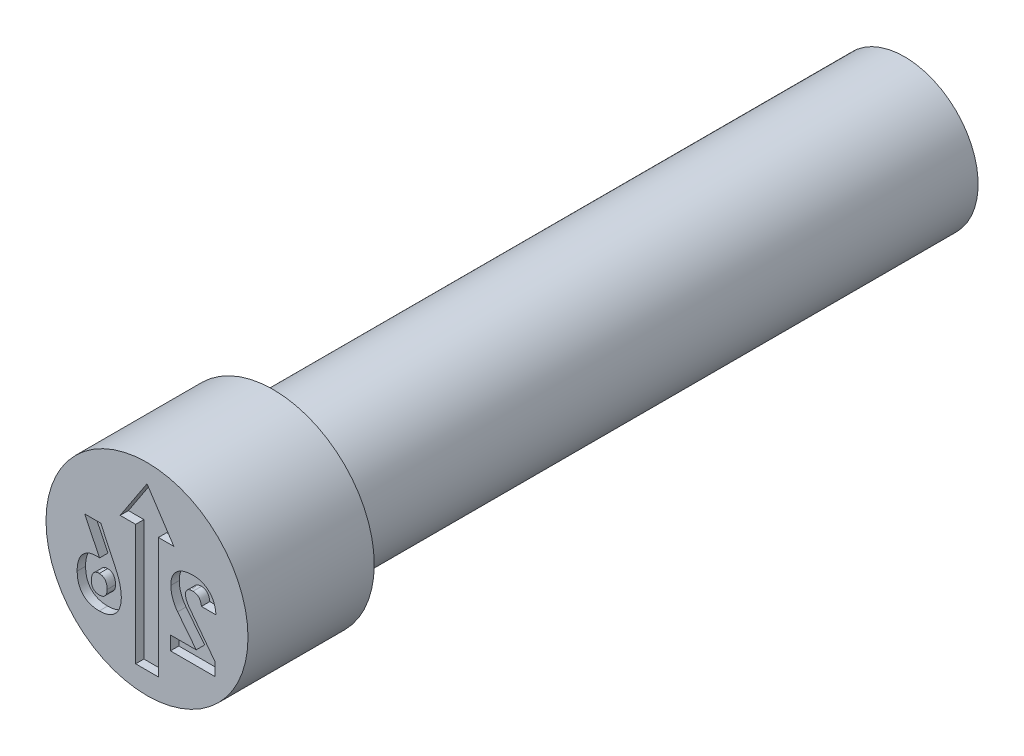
ISO-10303-21;
HEADER;
FILE_DESCRIPTION(('STEP AP214'),'2;1');
FILE_NAME('part.step','',(''),(''),'','','');
FILE_SCHEMA(('AUTOMOTIVE_DESIGN { 1 0 10303 214 1 1 1 1 }'));
ENDSEC;
DATA;
#1=APPLICATION_CONTEXT('core data for automotive mechanical design processes');
#2=APPLICATION_PROTOCOL_DEFINITION('international standard','automotive_design',2000,#1);
#3=PRODUCT_CONTEXT('',#1,'mechanical');
#4=PRODUCT('Part','Part','',(#3));
#5=PRODUCT_RELATED_PRODUCT_CATEGORY('part','',(#4));
#6=PRODUCT_DEFINITION_FORMATION('','',#4);
#7=PRODUCT_DEFINITION_CONTEXT('part definition',#1,'design');
#8=PRODUCT_DEFINITION('design','',#6,#7);
#9=PRODUCT_DEFINITION_SHAPE('','',#8);
#10=(LENGTH_UNIT() NAMED_UNIT(*) SI_UNIT(.MILLI.,.METRE.));
#11=(NAMED_UNIT(*) PLANE_ANGLE_UNIT() SI_UNIT($,.RADIAN.));
#12=(NAMED_UNIT(*) SI_UNIT($,.STERADIAN.) SOLID_ANGLE_UNIT());
#13=UNCERTAINTY_MEASURE_WITH_UNIT(LENGTH_MEASURE(1.E-05),#10,'distance_accuracy_value','');
#14=(GEOMETRIC_REPRESENTATION_CONTEXT(3) GLOBAL_UNCERTAINTY_ASSIGNED_CONTEXT((#13)) GLOBAL_UNIT_ASSIGNED_CONTEXT((#10,
#11,#12)) REPRESENTATION_CONTEXT('',''));
#15=CARTESIAN_POINT('',(0.,0.,0.));
#16=DIRECTION('',(0.,0.,1.));
#17=DIRECTION('',(1.,0.,0.));
#18=AXIS2_PLACEMENT_3D('',#15,#16,#17);
#19=CARTESIAN_POINT('',(1.1999976,0.,0.));
#20=DIRECTION('',(0.,0.,1.));
#21=DIRECTION('',(1.,0.,0.));
#22=AXIS2_PLACEMENT_3D('',#19,#20,#21);
#23=PLANE('',#22);
#24=CARTESIAN_POINT('',(-1.65962662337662,-0.668547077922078,0.));
#25=CARTESIAN_POINT('',(-1.65923377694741,-0.689872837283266,0.));
#26=CARTESIAN_POINT('',(-1.65846632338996,-0.731534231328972,0.));
#27=CARTESIAN_POINT('',(-1.65169676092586,-0.792083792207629,0.));
#28=CARTESIAN_POINT('',(-1.64132435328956,-0.849077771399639,0.));
#29=CARTESIAN_POINT('',(-1.62634958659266,-0.902306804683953,0.));
#30=CARTESIAN_POINT('',(-1.6069790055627,-0.951903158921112,0.));
#31=CARTESIAN_POINT('',(-1.58318254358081,-0.99788357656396,0.));
#32=CARTESIAN_POINT('',(-1.55485071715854,-1.04002112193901,0.));
#33=CARTESIAN_POINT('',(-1.52278928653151,-1.07862131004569,0.));
#34=CARTESIAN_POINT('',(-1.48640172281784,-1.11258783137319,0.));
#35=CARTESIAN_POINT('',(-1.44666396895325,-1.14243331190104,0.));
#36=CARTESIAN_POINT('',(-1.40343618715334,-1.16793328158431,0.));
#37=CARTESIAN_POINT('',(-1.3560783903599,-1.18777027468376,0.));
#38=CARTESIAN_POINT('',(-1.30567398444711,-1.20405412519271,0.));
#39=CARTESIAN_POINT('',(-1.25152919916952,-1.21511521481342,0.));
#40=CARTESIAN_POINT('',(-1.19411516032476,-1.22230637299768,0.));
#41=CARTESIAN_POINT('',(-1.15461712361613,-1.22301408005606,0.));
#42=CARTESIAN_POINT('',(-1.13438311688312,-1.22337662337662,0.));
#43=B_SPLINE_CURVE_WITH_KNOTS('',3,(#24,#25,#26,#27,#28,#29,#30,#31,#32,#33,#34,#35,#36,#37,#38,
#39,#40,#41,#42),.UNSPECIFIED.,.F.,.F.,(4,1,1,1,1,1,1,1,1,1,1,1,1,1,1,1,4),(0.,
0.0736363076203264,0.143853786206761,0.210167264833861,0.273535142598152,0.334525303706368,
0.393774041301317,0.451974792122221,0.509587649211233,0.566708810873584,0.623480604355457,
0.680964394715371,0.739551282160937,0.800463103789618,0.863640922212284,0.930146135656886,1.),.UNSPECIFIED.);
#44=CARTESIAN_POINT('',(-1.65962662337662,-0.668547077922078,0.));
#45=VERTEX_POINT('',#44);
#46=CARTESIAN_POINT('',(-1.13438311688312,-1.22337662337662,0.));
#47=VERTEX_POINT('',#46);
#48=EDGE_CURVE('E54',#45,#47,#43,.T.);
#49=ORIENTED_EDGE('',*,*,#48,.F.);
#50=DIRECTION('',(0.,-1.,0.));
#51=VECTOR('',#50,1.);
#52=CARTESIAN_POINT('',(-1.65962662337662,-0.667086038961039,0.));
#53=LINE('',#52,#51);
#54=CARTESIAN_POINT('',(-1.65962662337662,-0.667086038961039,0.));
#55=VERTEX_POINT('',#54);
#56=EDGE_CURVE('E425',#55,#45,#53,.T.);
#57=ORIENTED_EDGE('',*,*,#56,.F.);
#58=CARTESIAN_POINT('',(-1.19245941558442,-0.124675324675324,0.));
#59=CARTESIAN_POINT('',(-1.21049685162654,-0.125084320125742,0.));
#60=CARTESIAN_POINT('',(-1.24560228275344,-0.125880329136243,0.));
#61=CARTESIAN_POINT('',(-1.29668364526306,-0.132392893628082,0.));
#62=CARTESIAN_POINT('',(-1.34442301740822,-0.143933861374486,0.));
#63=CARTESIAN_POINT('',(-1.38942136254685,-0.159083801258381,0.));
#64=CARTESIAN_POINT('',(-1.43120624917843,-0.179286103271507,0.));
#65=CARTESIAN_POINT('',(-1.46988130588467,-0.204005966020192,0.));
#66=CARTESIAN_POINT('',(-1.50553667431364,-0.232947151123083,0.));
#67=CARTESIAN_POINT('',(-1.53770243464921,-0.266457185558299,0.));
#68=CARTESIAN_POINT('',(-1.56668022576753,-0.303681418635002,0.));
#69=CARTESIAN_POINT('',(-1.59151301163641,-0.344995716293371,0.));
#70=CARTESIAN_POINT('',(-1.61285359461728,-0.389709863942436,0.));
#71=CARTESIAN_POINT('',(-1.62985503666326,-0.438270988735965,0.));
#72=CARTESIAN_POINT('',(-1.64348093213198,-0.490284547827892,0.));
#73=CARTESIAN_POINT('',(-1.65268142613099,-0.546045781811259,0.));
#74=CARTESIAN_POINT('',(-1.65876606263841,-0.605343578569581,0.));
#75=CARTESIAN_POINT('',(-1.65933451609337,-0.646128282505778,0.));
#76=CARTESIAN_POINT('',(-1.65962662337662,-0.667086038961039,0.));
#77=B_SPLINE_CURVE_WITH_KNOTS('',3,(#58,#59,#60,#61,#62,#63,#64,#65,#66,#67,#68,#69,#70,#71,#72,
#73,#74,#75,#76),.UNSPECIFIED.,.F.,.F.,(4,1,1,1,1,1,1,1,1,1,1,1,1,1,1,1,4),(0.,
0.0665766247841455,0.129575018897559,0.189644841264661,0.24763903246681,0.30453064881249,
0.36051483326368,0.416743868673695,0.473642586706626,0.531631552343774,0.590524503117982,
0.65124161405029,0.714220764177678,0.780176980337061,0.849489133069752,0.922658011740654,1.),.UNSPECIFIED.);
#78=CARTESIAN_POINT('',(-1.19245941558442,-0.124675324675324,0.));
#79=VERTEX_POINT('',#78);
#80=EDGE_CURVE('E417',#79,#55,#77,.T.);
#81=ORIENTED_EDGE('',*,*,#80,.F.);
#82=CARTESIAN_POINT('',(-0.964172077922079,-0.247402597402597,0.));
#83=CARTESIAN_POINT('',(-0.969705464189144,-0.237573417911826,0.));
#84=CARTESIAN_POINT('',(-0.980550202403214,-0.218309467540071,0.));
#85=CARTESIAN_POINT('',(-1.00191267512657,-0.193377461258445,0.));
#86=CARTESIAN_POINT('',(-1.02573806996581,-0.171726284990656,0.));
#87=CARTESIAN_POINT('',(-1.05329249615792,-0.154505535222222,0.));
#88=CARTESIAN_POINT('',(-1.08375906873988,-0.140881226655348,0.));
#89=CARTESIAN_POINT('',(-1.11738697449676,-0.131593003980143,0.));
#90=CARTESIAN_POINT('',(-1.1538855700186,-0.125499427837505,0.));
#91=CARTESIAN_POINT('',(-1.17928334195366,-0.124956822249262,0.));
#92=CARTESIAN_POINT('',(-1.19245941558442,-0.124675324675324,0.));
#93=B_SPLINE_CURVE_WITH_KNOTS('',3,(#82,#83,#84,#85,#86,#87,#88,#89,#90,#91,#92),.UNSPECIFIED.,
.F.,.F.,(4,1,1,1,1,1,1,1,4),(0.,0.123274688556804,0.241602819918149,0.357777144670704,
0.474683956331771,0.595870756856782,0.722082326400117,0.855819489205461,1.),.UNSPECIFIED.);
#94=CARTESIAN_POINT('',(-1.12753344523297,-0.130151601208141,0.));
#95=VERTEX_POINT('',#94);
#96=EDGE_CURVE('E412',#95,#79,#93,.T.);
#97=ORIENTED_EDGE('',*,*,#96,.F.);
#98=DIRECTION('',(0.435377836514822,-0.900247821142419,0.));
#99=VECTOR('',#98,1.);
#100=CARTESIAN_POINT('',(-1.48064935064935,0.6,0.));
#101=LINE('',#100,#99);
#102=CARTESIAN_POINT('',(-1.48064935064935,0.6,0.));
#103=VERTEX_POINT('',#102);
#104=EDGE_CURVE('E409',#103,#95,#101,.T.);
#105=ORIENTED_EDGE('',*,*,#104,.F.);
#106=DIRECTION('',(-1.,0.,0.));
#107=VECTOR('',#106,1.);
#108=CARTESIAN_POINT('',(-1.09858766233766,0.6,0.));
#109=LINE('',#108,#107);
#110=CARTESIAN_POINT('',(-1.09858766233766,0.6,0.));
#111=VERTEX_POINT('',#110);
#112=EDGE_CURVE('E406',#111,#103,#109,.T.);
#113=ORIENTED_EDGE('',*,*,#112,.F.);
#114=DIRECTION('',(-0.42407385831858,0.905627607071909,0.));
#115=VECTOR('',#114,1.);
#116=CARTESIAN_POINT('',(-0.734788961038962,-0.176907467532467,0.));
#117=LINE('',#116,#115);
#118=CARTESIAN_POINT('',(-0.734788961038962,-0.176907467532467,0.));
#119=VERTEX_POINT('',#118);
#120=EDGE_CURVE('E400',#119,#111,#117,.T.);
#121=ORIENTED_EDGE('',*,*,#120,.F.);
#122=CARTESIAN_POINT('',(-0.61060064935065,-0.677313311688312,0.));
#123=CARTESIAN_POINT('',(-0.611061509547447,-0.657573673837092,0.));
#124=CARTESIAN_POINT('',(-0.61199958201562,-0.617394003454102,0.));
#125=CARTESIAN_POINT('',(-0.618542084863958,-0.556410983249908,0.));
#126=CARTESIAN_POINT('',(-0.628651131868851,-0.493796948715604,0.));
#127=CARTESIAN_POINT('',(-0.643479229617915,-0.43011222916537,0.));
#128=CARTESIAN_POINT('',(-0.661559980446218,-0.366008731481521,0.));
#129=CARTESIAN_POINT('',(-0.682978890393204,-0.302224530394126,0.));
#130=CARTESIAN_POINT('',(-0.706795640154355,-0.238909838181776,0.));
#131=CARTESIAN_POINT('',(-0.725431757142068,-0.197632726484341,0.));
#132=CARTESIAN_POINT('',(-0.734788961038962,-0.176907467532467,0.));
#133=B_SPLINE_CURVE_WITH_KNOTS('',3,(#122,#123,#124,#125,#126,#127,#128,#129,#130,#131,#132),
.UNSPECIFIED.,.F.,.F.,(4,1,1,1,1,1,1,1,4),(0.,0.114002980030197,0.232050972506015,
0.353906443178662,0.480147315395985,0.609491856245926,0.738474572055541,0.868687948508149,1.),.UNSPECIFIED.);
#134=CARTESIAN_POINT('',(-0.61060064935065,-0.677313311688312,0.));
#135=VERTEX_POINT('',#134);
#136=EDGE_CURVE('E395',#135,#119,#133,.T.);
#137=ORIENTED_EDGE('',*,*,#136,.F.);
#138=DIRECTION('',(0.,1.,0.));
#139=VECTOR('',#138,1.);
#140=CARTESIAN_POINT('',(-0.61060064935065,-0.678409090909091,0.));
#141=LINE('',#140,#139);
#142=CARTESIAN_POINT('',(-0.61060064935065,-0.678409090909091,0.));
#143=VERTEX_POINT('',#142);
#144=EDGE_CURVE('E389',#143,#135,#141,.T.);
#145=ORIENTED_EDGE('',*,*,#144,.F.);
#146=CARTESIAN_POINT('',(-1.13438311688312,-1.22337662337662,0.));
#147=CARTESIAN_POINT('',(-1.11415510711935,-1.22297088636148,0.));
#148=CARTESIAN_POINT('',(-1.0748040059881,-1.22218157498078,0.));
#149=CARTESIAN_POINT('',(-1.01755892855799,-1.21563712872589,0.));
#150=CARTESIAN_POINT('',(-0.963899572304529,-1.20426977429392,0.));
#151=CARTESIAN_POINT('',(-0.913590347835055,-1.18858209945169,0.));
#152=CARTESIAN_POINT('',(-0.866629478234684,-1.16852861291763,0.));
#153=CARTESIAN_POINT('',(-0.823225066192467,-1.14394324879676,0.));
#154=CARTESIAN_POINT('',(-0.783355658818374,-1.11480868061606,0.));
#155=CARTESIAN_POINT('',(-0.747222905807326,-1.08118784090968,0.));
#156=CARTESIAN_POINT('',(-0.715080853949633,-1.04350012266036,0.));
#157=CARTESIAN_POINT('',(-0.687005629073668,-1.00211366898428,0.));
#158=CARTESIAN_POINT('',(-0.663234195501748,-0.957041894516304,0.));
#159=CARTESIAN_POINT('',(-0.643954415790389,-0.908261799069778,0.));
#160=CARTESIAN_POINT('',(-0.628832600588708,-0.855923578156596,0.));
#161=CARTESIAN_POINT('',(-0.618605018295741,-0.799991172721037,0.));
#162=CARTESIAN_POINT('',(-0.611716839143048,-0.740430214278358,0.));
#163=CARTESIAN_POINT('',(-0.610980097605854,-0.699493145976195,0.));
#164=CARTESIAN_POINT('',(-0.61060064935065,-0.678409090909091,0.));
#165=B_SPLINE_CURVE_WITH_KNOTS('',3,(#146,#147,#148,#149,#150,#151,#152,#153,#154,#155,#156,
#157,#158,#159,#160,#161,#162,#163,#164),.UNSPECIFIED.,.F.,.F.,(4,1,1,1,1,1,1,1,1,1,1,1,1,1,1,1,
4),(0.,0.0706034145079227,0.137350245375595,0.20079014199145,0.261822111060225,
0.321037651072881,0.37871381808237,0.435588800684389,0.493032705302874,0.550614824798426,
0.60814515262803,0.667276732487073,0.728130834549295,0.790952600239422,0.857142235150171,
0.926423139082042,1.),.UNSPECIFIED.);
#166=EDGE_CURVE('E381',#47,#143,#165,.T.);
#167=ORIENTED_EDGE('',*,*,#166,.F.);
#168=EDGE_LOOP('',(#49,#57,#81,#97,#105,#113,#121,#137,#145,#167));
#169=FACE_BOUND('',#168,.T.);
#170=DIRECTION('',(1.,0.,0.));
#171=VECTOR('',#170,1.);
#172=CARTESIAN_POINT('',(0.556696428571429,-1.2,0.));
#173=LINE('',#172,#171);
#174=CARTESIAN_POINT('',(0.556696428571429,-1.2,0.));
#175=VERTEX_POINT('',#174);
#176=CARTESIAN_POINT('',(1.61668019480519,-1.2,0.));
#177=VERTEX_POINT('',#176);
#178=EDGE_CURVE('E434',#175,#177,#173,.T.);
#179=ORIENTED_EDGE('',*,*,#178,.F.);
#180=DIRECTION('',(0.,-1.,0.));
#181=VECTOR('',#180,1.);
#182=CARTESIAN_POINT('',(0.556696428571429,-0.872727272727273,0.));
#183=LINE('',#182,#181);
#184=CARTESIAN_POINT('',(0.556696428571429,-0.872727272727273,0.));
#185=VERTEX_POINT('',#184);
#186=EDGE_CURVE('E456',#185,#175,#183,.T.);
#187=ORIENTED_EDGE('',*,*,#186,.F.);
#188=DIRECTION('',(-1.,0.,0.));
#189=VECTOR('',#188,1.);
#190=CARTESIAN_POINT('',(1.16923701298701,-0.872727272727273,0.));
#191=LINE('',#190,#189);
#192=CARTESIAN_POINT('',(1.16923701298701,-0.872727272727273,0.));
#193=VERTEX_POINT('',#192);
#194=EDGE_CURVE('E673',#193,#185,#191,.T.);
#195=ORIENTED_EDGE('',*,*,#194,.F.);
#196=DIRECTION('',(0.618183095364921,-0.786034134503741,0.));
#197=VECTOR('',#196,1.);
#198=CARTESIAN_POINT('',(0.728003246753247,-0.311688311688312,0.));
#199=LINE('',#198,#197);
#200=CARTESIAN_POINT('',(0.728003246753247,-0.311688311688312,0.));
#201=VERTEX_POINT('',#200);
#202=EDGE_CURVE('E676',#201,#193,#199,.T.);
#203=ORIENTED_EDGE('',*,*,#202,.F.);
#204=CARTESIAN_POINT('',(0.566558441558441,0.151461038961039,0.));
#205=CARTESIAN_POINT('',(0.567024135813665,0.130980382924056,0.));
#206=CARTESIAN_POINT('',(0.567956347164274,0.0899828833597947,0.));
#207=CARTESIAN_POINT('',(0.576371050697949,0.0286244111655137,0.));
#208=CARTESIAN_POINT('',(0.589931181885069,-0.0324207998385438,0.));
#209=CARTESIAN_POINT('',(0.608554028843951,-0.0928578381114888,0.));
#210=CARTESIAN_POINT('',(0.631688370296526,-0.151639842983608,0.));
#211=CARTESIAN_POINT('',(0.659454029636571,-0.207961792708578,0.));
#212=CARTESIAN_POINT('',(0.690791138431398,-0.261848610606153,0.));
#213=CARTESIAN_POINT('',(0.715622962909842,-0.295106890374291,0.));
#214=CARTESIAN_POINT('',(0.728003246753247,-0.311688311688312,0.));
#215=B_SPLINE_CURVE_WITH_KNOTS('',3,(#204,#205,#206,#207,#208,#209,#210,#211,#212,#213,#214),
.UNSPECIFIED.,.F.,.F.,(4,1,1,1,1,1,1,1,4),(0.,0.123046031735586,0.246309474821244,
0.371480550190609,0.498560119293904,0.626024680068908,0.750715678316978,0.875715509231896,1.),.UNSPECIFIED.);
#216=CARTESIAN_POINT('',(0.566558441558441,0.151461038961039,0.));
#217=VERTEX_POINT('',#216);
#218=EDGE_CURVE('E679',#217,#201,#215,.T.);
#219=ORIENTED_EDGE('',*,*,#218,.F.);
#220=DIRECTION('',(0.,-1.,0.));
#221=VECTOR('',#220,1.);
#222=CARTESIAN_POINT('',(0.566558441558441,0.152922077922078,0.));
#223=LINE('',#222,#221);
#224=CARTESIAN_POINT('',(0.566558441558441,0.152922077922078,0.));
#225=VERTEX_POINT('',#224);
#226=EDGE_CURVE('E684',#225,#217,#223,.T.);
#227=ORIENTED_EDGE('',*,*,#226,.F.);
#228=CARTESIAN_POINT('',(1.09655032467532,0.623376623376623,0.));
#229=CARTESIAN_POINT('',(1.07607927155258,0.623085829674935,0.));
#230=CARTESIAN_POINT('',(1.03626578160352,0.622520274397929,0.));
#231=CARTESIAN_POINT('',(0.978304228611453,0.61641528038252,0.));
#232=CARTESIAN_POINT('',(0.923768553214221,0.607201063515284,0.));
#233=CARTESIAN_POINT('',(0.872746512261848,0.593721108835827,0.));
#234=CARTESIAN_POINT('',(0.825442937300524,0.576137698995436,0.));
#235=CARTESIAN_POINT('',(0.781716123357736,0.554936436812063,0.));
#236=CARTESIAN_POINT('',(0.741474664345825,0.529936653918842,0.));
#237=CARTESIAN_POINT('',(0.705026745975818,0.501084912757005,0.));
#238=CARTESIAN_POINT('',(0.672232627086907,0.468905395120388,0.));
#239=CARTESIAN_POINT('',(0.644005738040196,0.433071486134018,0.));
#240=CARTESIAN_POINT('',(0.619570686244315,0.394307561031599,0.));
#241=CARTESIAN_POINT('',(0.600469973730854,0.351861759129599,0.));
#242=CARTESIAN_POINT('',(0.584744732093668,0.306732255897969,0.));
#243=CARTESIAN_POINT('',(0.574562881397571,0.25811011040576,0.));
#244=CARTESIAN_POINT('',(0.567701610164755,0.206567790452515,0.));
#245=CARTESIAN_POINT('',(0.566945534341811,0.171087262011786,0.));
#246=CARTESIAN_POINT('',(0.566558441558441,0.152922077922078,0.));
#247=B_SPLINE_CURVE_WITH_KNOTS('',3,(#228,#229,#230,#231,#232,#233,#234,#235,#236,#237,#238,
#239,#240,#241,#242,#243,#244,#245,#246),.UNSPECIFIED.,.F.,.F.,(4,1,1,1,1,1,1,1,1,1,1,1,1,1,1,1,
4),(0.,0.0762312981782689,0.148259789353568,0.216860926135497,0.28210063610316,
0.344528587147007,0.404571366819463,0.462840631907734,0.520642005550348,0.577409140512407,
0.633580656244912,0.690215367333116,0.747647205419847,0.806597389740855,0.867894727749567,
0.932365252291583,1.),.UNSPECIFIED.);
#248=CARTESIAN_POINT('',(1.09655032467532,0.623376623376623,0.));
#249=VERTEX_POINT('',#248);
#250=EDGE_CURVE('E690',#249,#225,#247,.T.);
#251=ORIENTED_EDGE('',*,*,#250,.F.);
#252=CARTESIAN_POINT('',(1.63896103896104,0.0831574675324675,0.));
#253=CARTESIAN_POINT('',(1.63725243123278,0.10402199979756,0.));
#254=CARTESIAN_POINT('',(1.63391726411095,0.144749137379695,0.));
#255=CARTESIAN_POINT('',(1.62298313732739,0.203662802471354,0.));
#256=CARTESIAN_POINT('',(1.608851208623,0.25915544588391,0.));
#257=CARTESIAN_POINT('',(1.59087349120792,0.311216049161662,0.));
#258=CARTESIAN_POINT('',(1.56777206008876,0.359241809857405,0.));
#259=CARTESIAN_POINT('',(1.54181690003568,0.404236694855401,0.));
#260=CARTESIAN_POINT('',(1.51059934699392,0.444809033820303,0.));
#261=CARTESIAN_POINT('',(1.47642736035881,0.482316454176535,0.));
#262=CARTESIAN_POINT('',(1.43836587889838,0.515352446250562,0.));
#263=CARTESIAN_POINT('',(1.39778188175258,0.544494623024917,0.));
#264=CARTESIAN_POINT('',(1.35406167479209,0.568745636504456,0.));
#265=CARTESIAN_POINT('',(1.30786992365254,0.588863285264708,0.));
#266=CARTESIAN_POINT('',(1.2586944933,0.604132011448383,0.));
#267=CARTESIAN_POINT('',(1.2071777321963,0.615569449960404,0.));
#268=CARTESIAN_POINT('',(1.15272832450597,0.622165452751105,0.));
#269=CARTESIAN_POINT('',(1.11556147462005,0.622966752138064,0.));
#270=CARTESIAN_POINT('',(1.09655032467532,0.623376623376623,0.));
#271=B_SPLINE_CURVE_WITH_KNOTS('',3,(#252,#253,#254,#255,#256,#257,#258,#259,#260,#261,#262,
#263,#264,#265,#266,#267,#268,#269,#270),.UNSPECIFIED.,.F.,.F.,(4,1,1,1,1,1,1,1,1,1,1,1,1,1,1,1,
4),(0.,0.0733268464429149,0.14313249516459,0.209679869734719,0.273918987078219,
0.335762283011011,0.396210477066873,0.45560885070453,0.514796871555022,0.573764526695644,
0.631900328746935,0.689592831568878,0.748648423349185,0.808163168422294,0.86976604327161,
0.933384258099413,1.),.UNSPECIFIED.);
#272=CARTESIAN_POINT('',(1.63896103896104,0.0831574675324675,0.));
#273=VERTEX_POINT('',#272);
#274=EDGE_CURVE('E695',#273,#249,#271,.T.);
#275=ORIENTED_EDGE('',*,*,#274,.F.);
#276=DIRECTION('',(0.,1.,0.));
#277=VECTOR('',#276,1.);
#278=CARTESIAN_POINT('',(1.63896103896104,0.0820616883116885,0.));
#279=LINE('',#278,#277);
#280=CARTESIAN_POINT('',(1.63896103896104,0.0820616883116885,0.));
#281=VERTEX_POINT('',#280);
#282=EDGE_CURVE('E703',#281,#273,#279,.T.);
#283=ORIENTED_EDGE('',*,*,#282,.F.);
#284=DIRECTION('',(1.,0.,0.));
#285=VECTOR('',#284,1.);
#286=CARTESIAN_POINT('',(1.29269480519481,0.0820616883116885,0.));
#287=LINE('',#286,#285);
#288=CARTESIAN_POINT('',(1.29269480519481,0.0820616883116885,0.));
#289=VERTEX_POINT('',#288);
#290=EDGE_CURVE('E709',#289,#281,#287,.T.);
#291=ORIENTED_EDGE('',*,*,#290,.F.);
#292=DIRECTION('',(0.,-1.,0.));
#293=VECTOR('',#292,1.);
#294=CARTESIAN_POINT('',(1.29269480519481,0.0831574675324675,0.));
#295=LINE('',#294,#293);
#296=CARTESIAN_POINT('',(1.29269480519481,0.0831574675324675,0.));
#297=VERTEX_POINT('',#296);
#298=EDGE_CURVE('E712',#297,#289,#295,.T.);
#299=ORIENTED_EDGE('',*,*,#298,.F.);
#300=CARTESIAN_POINT('',(1.09399350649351,0.296103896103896,0.));
#301=CARTESIAN_POINT('',(1.10722614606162,0.295587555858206,0.));
#302=CARTESIAN_POINT('',(1.13293762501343,0.294584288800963,0.));
#303=CARTESIAN_POINT('',(1.16933660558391,0.283465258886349,0.));
#304=CARTESIAN_POINT('',(1.20213563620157,0.266024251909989,0.));
#305=CARTESIAN_POINT('',(1.23041100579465,0.241138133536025,0.));
#306=CARTESIAN_POINT('',(1.2538251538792,0.20989267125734,0.));
#307=CARTESIAN_POINT('',(1.27282800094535,0.173098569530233,0.));
#308=CARTESIAN_POINT('',(1.28573459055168,0.130091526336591,0.));
#309=CARTESIAN_POINT('',(1.29030007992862,0.0993055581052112,0.));
#310=CARTESIAN_POINT('',(1.29269480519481,0.0831574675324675,0.));
#311=B_SPLINE_CURVE_WITH_KNOTS('',3,(#300,#301,#302,#303,#304,#305,#306,#307,#308,#309,#310),
.UNSPECIFIED.,.F.,.F.,(4,1,1,1,1,1,1,1,4),(0.,0.122603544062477,0.238222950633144,
0.350089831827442,0.465559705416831,0.585028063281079,0.711014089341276,0.848418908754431,1.),.UNSPECIFIED.);
#312=CARTESIAN_POINT('',(1.09399350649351,0.296103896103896,0.));
#313=VERTEX_POINT('',#312);
#314=EDGE_CURVE('E715',#313,#297,#311,.T.);
#315=ORIENTED_EDGE('',*,*,#314,.F.);
#316=CARTESIAN_POINT('',(0.914285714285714,0.143425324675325,0.));
#317=CARTESIAN_POINT('',(0.914784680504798,0.154934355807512,0.));
#318=CARTESIAN_POINT('',(0.915740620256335,0.17698382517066,0.));
#319=CARTESIAN_POINT('',(0.924747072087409,0.208051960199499,0.));
#320=CARTESIAN_POINT('',(0.939508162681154,0.235107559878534,0.));
#321=CARTESIAN_POINT('',(0.9606496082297,0.257455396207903,0.));
#322=CARTESIAN_POINT('',(0.986969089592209,0.275131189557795,0.));
#323=CARTESIAN_POINT('',(1.01846107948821,0.287588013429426,0.));
#324=CARTESIAN_POINT('',(1.05471353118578,0.294731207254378,0.));
#325=CARTESIAN_POINT('',(1.08044539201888,0.295630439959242,0.));
#326=CARTESIAN_POINT('',(1.09399350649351,0.296103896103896,0.));
#327=B_SPLINE_CURVE_WITH_KNOTS('',3,(#316,#317,#318,#319,#320,#321,#322,#323,#324,#325,#326),
.UNSPECIFIED.,.F.,.F.,(4,1,1,1,1,1,1,1,4),(0.,0.128749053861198,0.246662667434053,
0.359069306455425,0.47107757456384,0.588039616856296,0.711712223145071,0.848213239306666,1.),.UNSPECIFIED.);
#328=CARTESIAN_POINT('',(0.914285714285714,0.143425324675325,0.));
#329=VERTEX_POINT('',#328);
#330=EDGE_CURVE('E720',#329,#313,#327,.T.);
#331=ORIENTED_EDGE('',*,*,#330,.F.);
#332=DIRECTION('',(0.,1.,0.));
#333=VECTOR('',#332,1.);
#334=CARTESIAN_POINT('',(0.914285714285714,0.140868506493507,0.));
#335=LINE('',#334,#333);
#336=CARTESIAN_POINT('',(0.914285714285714,0.140868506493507,0.));
#337=VERTEX_POINT('',#336);
#338=EDGE_CURVE('E728',#337,#329,#335,.T.);
#339=ORIENTED_EDGE('',*,*,#338,.F.);
#340=CARTESIAN_POINT('',(1.00158279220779,-0.0790178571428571,0.));
#341=CARTESIAN_POINT('',(0.988699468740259,-0.0608645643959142,0.));
#342=CARTESIAN_POINT('',(0.963596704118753,-0.0254934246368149,0.));
#343=CARTESIAN_POINT('',(0.940876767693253,0.0230816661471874,0.));
#344=CARTESIAN_POINT('',(0.926723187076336,0.0611651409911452,0.));
#345=CARTESIAN_POINT('',(0.919977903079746,0.0887831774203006,0.));
#346=CARTESIAN_POINT('',(0.915166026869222,0.115133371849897,0.));
#347=CARTESIAN_POINT('',(0.914573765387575,0.132447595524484,0.));
#348=CARTESIAN_POINT('',(0.914285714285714,0.140868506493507,0.));
#349=B_SPLINE_CURVE_WITH_KNOTS('',3,(#340,#341,#342,#343,#344,#345,#346,#347,#348),
.UNSPECIFIED.,.F.,.F.,(4,1,1,1,1,1,4),(0.,0.27737542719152,0.540457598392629,0.666416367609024,
0.784009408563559,0.894951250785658,1.),.UNSPECIFIED.);
#350=CARTESIAN_POINT('',(1.00158279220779,-0.0790178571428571,0.));
#351=VERTEX_POINT('',#350);
#352=EDGE_CURVE('E734',#351,#337,#349,.T.);
#353=ORIENTED_EDGE('',*,*,#352,.F.);
#354=DIRECTION('',(-0.602458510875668,0.798150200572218,0.));
#355=VECTOR('',#354,1.);
#356=CARTESIAN_POINT('',(1.61668019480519,-0.893912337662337,0.));
#357=LINE('',#356,#355);
#358=CARTESIAN_POINT('',(1.61668019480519,-0.893912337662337,0.));
#359=VERTEX_POINT('',#358);
#360=EDGE_CURVE('E739',#359,#351,#357,.T.);
#361=ORIENTED_EDGE('',*,*,#360,.F.);
#362=DIRECTION('',(0.,1.,0.));
#363=VECTOR('',#362,1.);
#364=CARTESIAN_POINT('',(1.61668019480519,-1.2,0.));
#365=LINE('',#364,#363);
#366=EDGE_CURVE('E745',#177,#359,#365,.T.);
#367=ORIENTED_EDGE('',*,*,#366,.F.);
#368=EDGE_LOOP('',(#179,#187,#195,#203,#219,#227,#251,#275,#283,#291,#299,#315,#331,#339,#353,
#361,#367));
#369=FACE_BOUND('',#368,.T.);
#370=CARTESIAN_POINT('',(0.,0.,0.));
#371=DIRECTION('',(0.,0.,-1.));
#372=DIRECTION('',(-1.,0.,0.));
#373=AXIS2_PLACEMENT_3D('',#370,#371,#372);
#374=CIRCLE('',#373,2.3999952);
#375=CARTESIAN_POINT('',(-2.3999952,0.,0.));
#376=VERTEX_POINT('',#375);
#377=EDGE_CURVE('E41',#376,#376,#374,.T.);
#378=ORIENTED_EDGE('',*,*,#377,.F.);
#379=EDGE_LOOP('',(#378));
#380=FACE_BOUND('',#379,.T.);
#381=DIRECTION('',(0.,1.,0.));
#382=VECTOR('',#381,1.);
#383=CARTESIAN_POINT('',(0.27,0.,0.));
#384=LINE('',#383,#382);
#385=CARTESIAN_POINT('',(0.27,0.990629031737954,0.));
#386=VERTEX_POINT('',#385);
#387=CARTESIAN_POINT('',(0.27,-1.88,0.));
#388=VERTEX_POINT('',#387);
#389=EDGE_CURVE('E564',#386,#388,#384,.F.);
#390=ORIENTED_EDGE('',*,*,#389,.T.);
#391=DIRECTION('',(1.,0.,0.));
#392=VECTOR('',#391,1.);
#393=CARTESIAN_POINT('',(1.1999976,-1.88,0.));
#394=LINE('',#393,#392);
#395=CARTESIAN_POINT('',(-0.27,-1.88,0.));
#396=VERTEX_POINT('',#395);
#397=EDGE_CURVE('E567',#388,#396,#394,.F.);
#398=ORIENTED_EDGE('',*,*,#397,.T.);
#399=DIRECTION('',(0.,1.,0.));
#400=VECTOR('',#399,1.);
#401=CARTESIAN_POINT('',(-0.27,0.,0.));
#402=LINE('',#401,#400);
#403=CARTESIAN_POINT('',(-0.27,0.990629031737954,0.));
#404=VERTEX_POINT('',#403);
#405=EDGE_CURVE('E585',#396,#404,#402,.T.);
#406=ORIENTED_EDGE('',*,*,#405,.T.);
#407=DIRECTION('',(1.,0.,0.));
#408=VECTOR('',#407,1.);
#409=CARTESIAN_POINT('',(1.1999976,0.990629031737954,0.));
#410=LINE('',#409,#408);
#411=CARTESIAN_POINT('',(-0.638461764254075,0.990629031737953,0.));
#412=VERTEX_POINT('',#411);
#413=EDGE_CURVE('E582',#404,#412,#410,.F.);
#414=ORIENTED_EDGE('',*,*,#413,.T.);
#415=DIRECTION('',(0.550159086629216,0.835059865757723,0.));
#416=VECTOR('',#415,1.);
#417=CARTESIAN_POINT('',(-0.638461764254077,0.990629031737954,0.));
#418=LINE('',#417,#416);
#419=CARTESIAN_POINT('',(0.,1.95971926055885,0.));
#420=VERTEX_POINT('',#419);
#421=EDGE_CURVE('E579',#412,#420,#418,.T.);
#422=ORIENTED_EDGE('',*,*,#421,.T.);
#423=DIRECTION('',(0.550159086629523,-0.835059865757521,0.));
#424=VECTOR('',#423,1.);
#425=CARTESIAN_POINT('',(0.,1.95971926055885,0.));
#426=LINE('',#425,#424);
#427=CARTESIAN_POINT('',(0.638461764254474,0.990629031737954,0.));
#428=VERTEX_POINT('',#427);
#429=EDGE_CURVE('E574',#420,#428,#426,.T.);
#430=ORIENTED_EDGE('',*,*,#429,.T.);
#431=DIRECTION('',(1.,0.,0.));
#432=VECTOR('',#431,1.);
#433=CARTESIAN_POINT('',(1.1999976,0.990629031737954,0.));
#434=LINE('',#433,#432);
#435=EDGE_CURVE('E570',#428,#386,#434,.F.);
#436=ORIENTED_EDGE('',*,*,#435,.T.);
#437=EDGE_LOOP('',(#390,#398,#406,#414,#422,#430,#436));
#438=FACE_BOUND('',#437,.T.);
#439=ADVANCED_FACE('F37',(#169,#369,#380,#438),#23,.T.);
#440=CARTESIAN_POINT('',(-0.27,-1.88,-3.34769690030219));
#441=DIRECTION('',(-1.,0.,0.));
#442=DIRECTION('',(0.,0.,1.));
#443=AXIS2_PLACEMENT_3D('',#440,#441,#442);
#444=PLANE('',#443);
#445=DIRECTION('',(0.,-1.,0.));
#446=VECTOR('',#445,1.);
#447=CARTESIAN_POINT('',(-0.27,0.990629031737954,-0.19671914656));
#448=LINE('',#447,#446);
#449=CARTESIAN_POINT('',(-0.27,0.990629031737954,-0.19671914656));
#450=VERTEX_POINT('',#449);
#451=CARTESIAN_POINT('',(-0.27,-1.88,-0.19671914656));
#452=VERTEX_POINT('',#451);
#453=EDGE_CURVE('E620',#450,#452,#448,.T.);
#454=ORIENTED_EDGE('',*,*,#453,.F.);
#455=DIRECTION('',(0.,0.,1.));
#456=VECTOR('',#455,1.);
#457=CARTESIAN_POINT('',(-0.27,0.990629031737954,-0.21335957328));
#458=LINE('',#457,#456);
#459=EDGE_CURVE('E601',#404,#450,#458,.F.);
#460=ORIENTED_EDGE('',*,*,#459,.F.);
#461=ORIENTED_EDGE('',*,*,#405,.F.);
#462=DIRECTION('',(0.,0.,-1.));
#463=VECTOR('',#462,1.);
#464=CARTESIAN_POINT('',(-0.27,-1.88,-3.34769690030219));
#465=LINE('',#464,#463);
#466=EDGE_CURVE('E587',#396,#452,#465,.T.);
#467=ORIENTED_EDGE('',*,*,#466,.T.);
#468=EDGE_LOOP('',(#454,#460,#461,#467));
#469=FACE_BOUND('',#468,.T.);
#470=ADVANCED_FACE('F39',(#469),#444,.F.);
#471=CARTESIAN_POINT('',(3.694814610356E-13,0.990629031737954,-0.21335957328));
#472=DIRECTION('',(0.,1.,0.));
#473=DIRECTION('',(0.,0.,1.));
#474=AXIS2_PLACEMENT_3D('',#471,#472,#473);
#475=PLANE('',#474);
#476=ORIENTED_EDGE('',*,*,#459,.T.);
#477=DIRECTION('',(1.,0.,0.));
#478=VECTOR('',#477,1.);
#479=CARTESIAN_POINT('',(-0.638461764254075,0.990629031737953,-0.19671914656));
#480=LINE('',#479,#478);
#481=CARTESIAN_POINT('',(-0.63846176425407,0.990629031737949,-0.19671914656));
#482=VERTEX_POINT('',#481);
#483=EDGE_CURVE('E625',#482,#450,#480,.T.);
#484=ORIENTED_EDGE('',*,*,#483,.F.);
#485=DIRECTION('',(0.,0.,1.));
#486=VECTOR('',#485,1.);
#487=CARTESIAN_POINT('',(-0.63846176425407,0.990629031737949,-0.97535804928));
#488=LINE('',#487,#486);
#489=EDGE_CURVE('E599',#482,#412,#488,.T.);
#490=ORIENTED_EDGE('',*,*,#489,.T.);
#491=ORIENTED_EDGE('',*,*,#413,.F.);
#492=EDGE_LOOP('',(#476,#484,#490,#491));
#493=FACE_BOUND('',#492,.T.);
#494=ADVANCED_FACE('F537',(#493),#475,.T.);
#495=CARTESIAN_POINT('',(-1.08287651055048,0.316073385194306,-0.97535804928));
#496=DIRECTION('',(-0.835059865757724,0.550159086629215,0.));
#497=DIRECTION('',(-0.550159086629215,-0.835059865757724,0.));
#498=AXIS2_PLACEMENT_3D('',#495,#496,#497);
#499=PLANE('',#498);
#500=DIRECTION('',(-0.550159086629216,-0.835059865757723,0.));
#501=VECTOR('',#500,1.);
#502=CARTESIAN_POINT('',(0.,1.95971926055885,-0.19671914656));
#503=LINE('',#502,#501);
#504=CARTESIAN_POINT('',(0.,1.95971926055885,-0.19671914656));
#505=VERTEX_POINT('',#504);
#506=EDGE_CURVE('E627',#505,#482,#503,.T.);
#507=ORIENTED_EDGE('',*,*,#506,.F.);
#508=DIRECTION('',(0.,0.,1.));
#509=VECTOR('',#508,1.);
#510=CARTESIAN_POINT('',(0.,1.95971926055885,-0.97535804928));
#511=LINE('',#510,#509);
#512=EDGE_CURVE('E597',#505,#420,#511,.T.);
#513=ORIENTED_EDGE('',*,*,#512,.T.);
#514=ORIENTED_EDGE('',*,*,#421,.F.);
#515=ORIENTED_EDGE('',*,*,#489,.F.);
#516=EDGE_LOOP('',(#507,#513,#514,#515));
#517=FACE_BOUND('',#516,.T.);
#518=ADVANCED_FACE('F534',(#517),#499,.F.);
#519=CARTESIAN_POINT('',(0.,1.95971926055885,-0.97535804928));
#520=DIRECTION('',(0.835059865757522,0.550159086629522,0.));
#521=DIRECTION('',(-0.550159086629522,0.835059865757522,0.));
#522=AXIS2_PLACEMENT_3D('',#519,#520,#521);
#523=PLANE('',#522);
#524=DIRECTION('',(-0.550159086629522,0.835059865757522,0.));
#525=VECTOR('',#524,1.);
#526=CARTESIAN_POINT('',(0.638461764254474,0.990629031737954,-0.19671914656));
#527=LINE('',#526,#525);
#528=CARTESIAN_POINT('',(0.638461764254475,0.990629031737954,-0.19671914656));
#529=VERTEX_POINT('',#528);
#530=EDGE_CURVE('E630',#529,#505,#527,.T.);
#531=ORIENTED_EDGE('',*,*,#530,.F.);
#532=DIRECTION('',(0.,0.,1.));
#533=VECTOR('',#532,1.);
#534=CARTESIAN_POINT('',(0.638461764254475,0.990629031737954,-0.21335957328));
#535=LINE('',#534,#533);
#536=EDGE_CURVE('E594',#428,#529,#535,.F.);
#537=ORIENTED_EDGE('',*,*,#536,.F.);
#538=ORIENTED_EDGE('',*,*,#429,.F.);
#539=ORIENTED_EDGE('',*,*,#512,.F.);
#540=EDGE_LOOP('',(#531,#537,#538,#539));
#541=FACE_BOUND('',#540,.T.);
#542=ADVANCED_FACE('F530',(#541),#523,.F.);
#543=CARTESIAN_POINT('',(3.694814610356E-13,0.990629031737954,-0.21335957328));
#544=DIRECTION('',(0.,1.,0.));
#545=DIRECTION('',(0.,0.,1.));
#546=AXIS2_PLACEMENT_3D('',#543,#544,#545);
#547=PLANE('',#546);
#548=ORIENTED_EDGE('',*,*,#536,.T.);
#549=DIRECTION('',(1.,0.,0.));
#550=VECTOR('',#549,1.);
#551=CARTESIAN_POINT('',(0.27,0.990629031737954,-0.19671914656));
#552=LINE('',#551,#550);
#553=CARTESIAN_POINT('',(0.27,0.990629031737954,-0.19671914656));
#554=VERTEX_POINT('',#553);
#555=EDGE_CURVE('E633',#554,#529,#552,.T.);
#556=ORIENTED_EDGE('',*,*,#555,.F.);
#557=DIRECTION('',(0.,0.,-1.));
#558=VECTOR('',#557,1.);
#559=CARTESIAN_POINT('',(0.27,0.990629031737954,-3.34769690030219));
#560=LINE('',#559,#558);
#561=EDGE_CURVE('E592',#554,#386,#560,.F.);
#562=ORIENTED_EDGE('',*,*,#561,.T.);
#563=ORIENTED_EDGE('',*,*,#435,.F.);
#564=EDGE_LOOP('',(#548,#556,#562,#563));
#565=FACE_BOUND('',#564,.T.);
#566=ADVANCED_FACE('F526',(#565),#547,.T.);
#567=CARTESIAN_POINT('',(0.27,-1.88,-3.34769690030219));
#568=DIRECTION('',(1.,0.,0.));
#569=DIRECTION('',(0.,0.,-1.));
#570=AXIS2_PLACEMENT_3D('',#567,#568,#569);
#571=PLANE('',#570);
#572=DIRECTION('',(0.,1.,0.));
#573=VECTOR('',#572,1.);
#574=CARTESIAN_POINT('',(0.27,-1.88,-0.19671914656));
#575=LINE('',#574,#573);
#576=CARTESIAN_POINT('',(0.27,-1.88,-0.19671914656));
#577=VERTEX_POINT('',#576);
#578=EDGE_CURVE('E602',#577,#554,#575,.T.);
#579=ORIENTED_EDGE('',*,*,#578,.F.);
#580=DIRECTION('',(0.,0.,-1.));
#581=VECTOR('',#580,1.);
#582=CARTESIAN_POINT('',(0.27,-1.88,-3.34769690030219));
#583=LINE('',#582,#581);
#584=EDGE_CURVE('E590',#577,#388,#583,.F.);
#585=ORIENTED_EDGE('',*,*,#584,.T.);
#586=ORIENTED_EDGE('',*,*,#389,.F.);
#587=ORIENTED_EDGE('',*,*,#561,.F.);
#588=EDGE_LOOP('',(#579,#585,#586,#587));
#589=FACE_BOUND('',#588,.T.);
#590=ADVANCED_FACE('F522',(#589),#571,.F.);
#591=CARTESIAN_POINT('',(-0.27,-1.88,-3.34769690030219));
#592=DIRECTION('',(0.,-1.,0.));
#593=DIRECTION('',(0.,0.,-1.));
#594=AXIS2_PLACEMENT_3D('',#591,#592,#593);
#595=PLANE('',#594);
#596=DIRECTION('',(1.,0.,0.));
#597=VECTOR('',#596,1.);
#598=CARTESIAN_POINT('',(-0.27,-1.88,-0.19671914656));
#599=LINE('',#598,#597);
#600=EDGE_CURVE('E616',#452,#577,#599,.T.);
#601=ORIENTED_EDGE('',*,*,#600,.F.);
#602=ORIENTED_EDGE('',*,*,#466,.F.);
#603=ORIENTED_EDGE('',*,*,#397,.F.);
#604=ORIENTED_EDGE('',*,*,#584,.F.);
#605=EDGE_LOOP('',(#601,#602,#603,#604));
#606=FACE_BOUND('',#605,.T.);
#607=ADVANCED_FACE('F504',(#606),#595,.F.);
#608=CARTESIAN_POINT('',(0.,0.,-1.499997));
#609=DIRECTION('',(0.,0.,-1.));
#610=DIRECTION('',(-1.,0.,0.));
#611=AXIS2_PLACEMENT_3D('',#608,#609,#610);
#612=CYLINDRICAL_SURFACE('',#611,2.3999952);
#613=ORIENTED_EDGE('',*,*,#377,.T.);
#614=EDGE_LOOP('',(#613));
#615=FACE_BOUND('',#614,.T.);
#616=CARTESIAN_POINT('',(0.,0.,-2.999994));
#617=DIRECTION('',(0.,0.,-1.));
#618=DIRECTION('',(-1.,0.,0.));
#619=AXIS2_PLACEMENT_3D('',#616,#617,#618);
#620=CIRCLE('',#619,2.3999952);
#621=CARTESIAN_POINT('',(-2.3999952,0.,-2.999994));
#622=VERTEX_POINT('',#621);
#623=EDGE_CURVE('E605',#622,#622,#620,.T.);
#624=ORIENTED_EDGE('',*,*,#623,.F.);
#625=EDGE_LOOP('',(#624));
#626=FACE_BOUND('',#625,.T.);
#627=ADVANCED_FACE('F499',(#615,#626),#612,.T.);
#628=CARTESIAN_POINT('',(0.87499825,0.,-17.999964));
#629=DIRECTION('',(0.,0.,-1.));
#630=DIRECTION('',(-1.,0.,0.));
#631=AXIS2_PLACEMENT_3D('',#628,#629,#630);
#632=PLANE('',#631);
#633=CARTESIAN_POINT('',(0.,0.,-17.999964));
#634=DIRECTION('',(0.,0.,-1.));
#635=DIRECTION('',(-1.,0.,0.));
#636=AXIS2_PLACEMENT_3D('',#633,#634,#635);
#637=CIRCLE('',#636,1.7499965);
#638=CARTESIAN_POINT('',(-1.74999649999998,0.,-17.999964));
#639=VERTEX_POINT('',#638);
#640=EDGE_CURVE('E46',#639,#639,#637,.F.);
#641=ORIENTED_EDGE('',*,*,#640,.F.);
#642=EDGE_LOOP('',(#641));
#643=FACE_BOUND('',#642,.T.);
#644=ADVANCED_FACE('F507',(#643),#632,.T.);
#645=CARTESIAN_POINT('',(2.07499585,0.,-2.999994));
#646=DIRECTION('',(0.,0.,-1.));
#647=DIRECTION('',(-1.,0.,0.));
#648=AXIS2_PLACEMENT_3D('',#645,#646,#647);
#649=PLANE('',#648);
#650=CARTESIAN_POINT('',(0.,0.,-2.999994));
#651=DIRECTION('',(0.,0.,-1.));
#652=DIRECTION('',(-1.,0.,0.));
#653=AXIS2_PLACEMENT_3D('',#650,#651,#652);
#654=CIRCLE('',#653,1.7499965);
#655=CARTESIAN_POINT('',(-1.74999649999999,0.,-2.999994));
#656=VERTEX_POINT('',#655);
#657=EDGE_CURVE('E11',#656,#656,#654,.T.);
#658=ORIENTED_EDGE('',*,*,#657,.F.);
#659=EDGE_LOOP('',(#658));
#660=FACE_BOUND('',#659,.T.);
#661=ORIENTED_EDGE('',*,*,#623,.T.);
#662=EDGE_LOOP('',(#661));
#663=FACE_BOUND('',#662,.T.);
#664=ADVANCED_FACE('F502',(#660,#663),#649,.T.);
#665=CARTESIAN_POINT('',(0.,0.,-10.499979));
#666=DIRECTION('',(0.,0.,-1.));
#667=DIRECTION('',(-1.,0.,0.));
#668=AXIS2_PLACEMENT_3D('',#665,#666,#667);
#669=CYLINDRICAL_SURFACE('',#668,1.7499965);
#670=ORIENTED_EDGE('',*,*,#640,.T.);
#671=EDGE_LOOP('',(#670));
#672=FACE_BOUND('',#671,.T.);
#673=ORIENTED_EDGE('',*,*,#657,.T.);
#674=EDGE_LOOP('',(#673));
#675=FACE_BOUND('',#674,.T.);
#676=ADVANCED_FACE('F497',(#672,#675),#669,.T.);
#677=CARTESIAN_POINT('',(0.,0.,-0.19671914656));
#678=DIRECTION('',(0.,0.,-1.));
#679=DIRECTION('',(-1.,0.,0.));
#680=AXIS2_PLACEMENT_3D('',#677,#678,#679);
#681=PLANE('',#680);
#682=ORIENTED_EDGE('',*,*,#555,.T.);
#683=ORIENTED_EDGE('',*,*,#530,.T.);
#684=ORIENTED_EDGE('',*,*,#506,.T.);
#685=ORIENTED_EDGE('',*,*,#483,.T.);
#686=ORIENTED_EDGE('',*,*,#453,.T.);
#687=ORIENTED_EDGE('',*,*,#600,.T.);
#688=ORIENTED_EDGE('',*,*,#578,.T.);
#689=EDGE_LOOP('',(#682,#683,#684,#685,#686,#687,#688));
#690=FACE_BOUND('',#689,.T.);
#691=ADVANCED_FACE('F493',(#690),#681,.F.);
#692=CARTESIAN_POINT('',(0.556696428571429,-1.2,-0.2));
#693=DIRECTION('',(0.,-1.,0.));
#694=DIRECTION('',(0.,0.,-1.));
#695=AXIS2_PLACEMENT_3D('',#692,#693,#694);
#696=PLANE('',#695);
#697=ORIENTED_EDGE('',*,*,#178,.T.);
#698=DIRECTION('',(0.,0.,1.));
#699=VECTOR('',#698,1.);
#700=CARTESIAN_POINT('',(1.61668019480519,-1.2,-0.2));
#701=LINE('',#700,#699);
#702=CARTESIAN_POINT('',(1.61668019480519,-1.2,-0.2));
#703=VERTEX_POINT('',#702);
#704=EDGE_CURVE('E636',#703,#177,#701,.T.);
#705=ORIENTED_EDGE('',*,*,#704,.F.);
#706=DIRECTION('',(1.,0.,0.));
#707=VECTOR('',#706,1.);
#708=CARTESIAN_POINT('',(0.556696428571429,-1.2,-0.2));
#709=LINE('',#708,#707);
#710=CARTESIAN_POINT('',(0.556696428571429,-1.2,-0.2));
#711=VERTEX_POINT('',#710);
#712=EDGE_CURVE('E452',#711,#703,#709,.T.);
#713=ORIENTED_EDGE('',*,*,#712,.F.);
#714=DIRECTION('',(0.,0.,1.));
#715=VECTOR('',#714,1.);
#716=CARTESIAN_POINT('',(0.556696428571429,-1.2,-0.2));
#717=LINE('',#716,#715);
#718=EDGE_CURVE('E635',#711,#175,#717,.T.);
#719=ORIENTED_EDGE('',*,*,#718,.T.);
#720=EDGE_LOOP('',(#697,#705,#713,#719));
#721=FACE_BOUND('',#720,.T.);
#722=ADVANCED_FACE('F489',(#721),#696,.F.);
#723=CARTESIAN_POINT('',(0.556696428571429,-0.872727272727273,-0.2));
#724=DIRECTION('',(-1.,0.,0.));
#725=DIRECTION('',(0.,0.,1.));
#726=AXIS2_PLACEMENT_3D('',#723,#724,#725);
#727=PLANE('',#726);
#728=ORIENTED_EDGE('',*,*,#186,.T.);
#729=ORIENTED_EDGE('',*,*,#718,.F.);
#730=DIRECTION('',(0.,-1.,0.));
#731=VECTOR('',#730,1.);
#732=CARTESIAN_POINT('',(0.556696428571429,-0.872727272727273,-0.2));
#733=LINE('',#732,#731);
#734=CARTESIAN_POINT('',(0.556696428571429,-0.872727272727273,-0.2));
#735=VERTEX_POINT('',#734);
#736=EDGE_CURVE('E640',#735,#711,#733,.T.);
#737=ORIENTED_EDGE('',*,*,#736,.F.);
#738=DIRECTION('',(0.,0.,1.));
#739=VECTOR('',#738,1.);
#740=CARTESIAN_POINT('',(0.556696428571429,-0.872727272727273,-0.2));
#741=LINE('',#740,#739);
#742=EDGE_CURVE('E668',#735,#185,#741,.T.);
#743=ORIENTED_EDGE('',*,*,#742,.T.);
#744=EDGE_LOOP('',(#728,#729,#737,#743));
#745=FACE_BOUND('',#744,.T.);
#746=ADVANCED_FACE('F492',(#745),#727,.F.);
#747=CARTESIAN_POINT('',(1.16923701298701,-0.872727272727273,-0.2));
#748=DIRECTION('',(0.,1.,0.));
#749=DIRECTION('',(0.,0.,1.));
#750=AXIS2_PLACEMENT_3D('',#747,#748,#749);
#751=PLANE('',#750);
#752=ORIENTED_EDGE('',*,*,#194,.T.);
#753=ORIENTED_EDGE('',*,*,#742,.F.);
#754=DIRECTION('',(-1.,0.,0.));
#755=VECTOR('',#754,1.);
#756=CARTESIAN_POINT('',(1.16923701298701,-0.872727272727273,-0.2));
#757=LINE('',#756,#755);
#758=CARTESIAN_POINT('',(1.16923701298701,-0.872727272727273,-0.2));
#759=VERTEX_POINT('',#758);
#760=EDGE_CURVE('E751',#759,#735,#757,.T.);
#761=ORIENTED_EDGE('',*,*,#760,.F.);
#762=DIRECTION('',(0.,0.,1.));
#763=VECTOR('',#762,1.);
#764=CARTESIAN_POINT('',(1.16923701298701,-0.872727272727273,-0.2));
#765=LINE('',#764,#763);
#766=EDGE_CURVE('E666',#759,#193,#765,.T.);
#767=ORIENTED_EDGE('',*,*,#766,.T.);
#768=EDGE_LOOP('',(#752,#753,#761,#767));
#769=FACE_BOUND('',#768,.T.);
#770=ADVANCED_FACE('F863',(#769),#751,.F.);
#771=CARTESIAN_POINT('',(0.728003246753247,-0.311688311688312,-0.2));
#772=DIRECTION('',(-0.786034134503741,-0.618183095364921,0.));
#773=DIRECTION('',(0.618183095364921,-0.786034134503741,0.));
#774=AXIS2_PLACEMENT_3D('',#771,#772,#773);
#775=PLANE('',#774);
#776=ORIENTED_EDGE('',*,*,#202,.T.);
#777=ORIENTED_EDGE('',*,*,#766,.F.);
#778=DIRECTION('',(0.618183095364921,-0.786034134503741,0.));
#779=VECTOR('',#778,1.);
#780=CARTESIAN_POINT('',(0.728003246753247,-0.311688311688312,-0.2));
#781=LINE('',#780,#779);
#782=CARTESIAN_POINT('',(0.728003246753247,-0.311688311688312,-0.2));
#783=VERTEX_POINT('',#782);
#784=EDGE_CURVE('E754',#783,#759,#781,.T.);
#785=ORIENTED_EDGE('',*,*,#784,.F.);
#786=DIRECTION('',(0.,0.,1.));
#787=VECTOR('',#786,1.);
#788=CARTESIAN_POINT('',(0.728003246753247,-0.311688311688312,-0.2));
#789=LINE('',#788,#787);
#790=EDGE_CURVE('E664',#783,#201,#789,.T.);
#791=ORIENTED_EDGE('',*,*,#790,.T.);
#792=EDGE_LOOP('',(#776,#777,#785,#791));
#793=FACE_BOUND('',#792,.T.);
#794=ADVANCED_FACE('F774',(#793),#775,.F.);
#795=CARTESIAN_POINT('',(0.566558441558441,0.151461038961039,-0.2));
#796=CARTESIAN_POINT('',(0.567024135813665,0.130980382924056,-0.2));
#797=CARTESIAN_POINT('',(0.567956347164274,0.0899828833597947,-0.2));
#798=CARTESIAN_POINT('',(0.576371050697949,0.0286244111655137,-0.2));
#799=CARTESIAN_POINT('',(0.589931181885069,-0.0324207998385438,-0.2));
#800=CARTESIAN_POINT('',(0.608554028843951,-0.0928578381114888,-0.2));
#801=CARTESIAN_POINT('',(0.631688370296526,-0.151639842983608,-0.2));
#802=CARTESIAN_POINT('',(0.659454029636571,-0.207961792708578,-0.2));
#803=CARTESIAN_POINT('',(0.690791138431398,-0.261848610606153,-0.2));
#804=CARTESIAN_POINT('',(0.715622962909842,-0.295106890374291,-0.2));
#805=CARTESIAN_POINT('',(0.728003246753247,-0.311688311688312,-0.2));
#806=B_SPLINE_CURVE_WITH_KNOTS('',3,(#795,#796,#797,#798,#799,#800,#801,#802,#803,#804,#805),
.UNSPECIFIED.,.F.,.F.,(4,1,1,1,1,1,1,1,4),(0.,0.123046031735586,0.246309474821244,
0.371480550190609,0.498560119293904,0.626024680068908,0.750715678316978,0.875715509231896,1.),.UNSPECIFIED.);
#807=DIRECTION('',(0.,0.,1.));
#808=VECTOR('',#807,1.);
#809=SURFACE_OF_LINEAR_EXTRUSION('',#806,#808);
#810=ORIENTED_EDGE('',*,*,#218,.T.);
#811=ORIENTED_EDGE('',*,*,#790,.F.);
#812=CARTESIAN_POINT('',(0.566558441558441,0.151461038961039,-0.2));
#813=VERTEX_POINT('',#812);
#814=EDGE_CURVE('E757',#813,#783,#806,.T.);
#815=ORIENTED_EDGE('',*,*,#814,.F.);
#816=DIRECTION('',(0.,0.,1.));
#817=VECTOR('',#816,1.);
#818=CARTESIAN_POINT('',(0.566558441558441,0.151461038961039,-0.2));
#819=LINE('',#818,#817);
#820=EDGE_CURVE('E662',#813,#217,#819,.T.);
#821=ORIENTED_EDGE('',*,*,#820,.T.);
#822=EDGE_LOOP('',(#810,#811,#815,#821));
#823=FACE_BOUND('',#822,.T.);
#824=ADVANCED_FACE('F769',(#823),#809,.F.);
#825=CARTESIAN_POINT('',(0.566558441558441,0.152922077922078,-0.2));
#826=DIRECTION('',(-1.,0.,0.));
#827=DIRECTION('',(0.,0.,1.));
#828=AXIS2_PLACEMENT_3D('',#825,#826,#827);
#829=PLANE('',#828);
#830=ORIENTED_EDGE('',*,*,#226,.T.);
#831=ORIENTED_EDGE('',*,*,#820,.F.);
#832=DIRECTION('',(0.,-1.,0.));
#833=VECTOR('',#832,1.);
#834=CARTESIAN_POINT('',(0.566558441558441,0.152922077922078,-0.2));
#835=LINE('',#834,#833);
#836=CARTESIAN_POINT('',(0.566558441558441,0.152922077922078,-0.2));
#837=VERTEX_POINT('',#836);
#838=EDGE_CURVE('E763',#837,#813,#835,.T.);
#839=ORIENTED_EDGE('',*,*,#838,.F.);
#840=DIRECTION('',(0.,0.,1.));
#841=VECTOR('',#840,1.);
#842=CARTESIAN_POINT('',(0.566558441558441,0.152922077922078,-0.2));
#843=LINE('',#842,#841);
#844=EDGE_CURVE('E660',#837,#225,#843,.T.);
#845=ORIENTED_EDGE('',*,*,#844,.T.);
#846=EDGE_LOOP('',(#830,#831,#839,#845));
#847=FACE_BOUND('',#846,.T.);
#848=ADVANCED_FACE('F773',(#847),#829,.F.);
#849=CARTESIAN_POINT('',(1.09655032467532,0.623376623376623,-0.2));
#850=CARTESIAN_POINT('',(1.07607927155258,0.623085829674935,-0.2));
#851=CARTESIAN_POINT('',(1.03626578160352,0.622520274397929,-0.2));
#852=CARTESIAN_POINT('',(0.978304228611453,0.61641528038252,-0.2));
#853=CARTESIAN_POINT('',(0.923768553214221,0.607201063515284,-0.2));
#854=CARTESIAN_POINT('',(0.872746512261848,0.593721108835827,-0.2));
#855=CARTESIAN_POINT('',(0.825442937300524,0.576137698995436,-0.2));
#856=CARTESIAN_POINT('',(0.781716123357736,0.554936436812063,-0.2));
#857=CARTESIAN_POINT('',(0.741474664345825,0.529936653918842,-0.2));
#858=CARTESIAN_POINT('',(0.705026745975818,0.501084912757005,-0.2));
#859=CARTESIAN_POINT('',(0.672232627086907,0.468905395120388,-0.2));
#860=CARTESIAN_POINT('',(0.644005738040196,0.433071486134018,-0.2));
#861=CARTESIAN_POINT('',(0.619570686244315,0.394307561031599,-0.2));
#862=CARTESIAN_POINT('',(0.600469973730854,0.351861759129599,-0.2));
#863=CARTESIAN_POINT('',(0.584744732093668,0.306732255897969,-0.2));
#864=CARTESIAN_POINT('',(0.574562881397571,0.25811011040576,-0.2));
#865=CARTESIAN_POINT('',(0.567701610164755,0.206567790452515,-0.2));
#866=CARTESIAN_POINT('',(0.566945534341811,0.171087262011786,-0.2));
#867=CARTESIAN_POINT('',(0.566558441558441,0.152922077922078,-0.2));
#868=B_SPLINE_CURVE_WITH_KNOTS('',3,(#849,#850,#851,#852,#853,#854,#855,#856,#857,#858,#859,
#860,#861,#862,#863,#864,#865,#866,#867),.UNSPECIFIED.,.F.,.F.,(4,1,1,1,1,1,1,1,1,1,1,1,1,1,1,1,
4),(0.,0.0762312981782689,0.148259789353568,0.216860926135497,0.28210063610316,
0.344528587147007,0.404571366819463,0.462840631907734,0.520642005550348,0.577409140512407,
0.633580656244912,0.690215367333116,0.747647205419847,0.806597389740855,0.867894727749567,
0.932365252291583,1.),.UNSPECIFIED.);
#869=DIRECTION('',(0.,0.,1.));
#870=VECTOR('',#869,1.);
#871=SURFACE_OF_LINEAR_EXTRUSION('',#868,#870);
#872=ORIENTED_EDGE('',*,*,#250,.T.);
#873=ORIENTED_EDGE('',*,*,#844,.F.);
#874=CARTESIAN_POINT('',(1.09655032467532,0.623376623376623,-0.2));
#875=VERTEX_POINT('',#874);
#876=EDGE_CURVE('E787',#875,#837,#868,.T.);
#877=ORIENTED_EDGE('',*,*,#876,.F.);
#878=DIRECTION('',(0.,0.,1.));
#879=VECTOR('',#878,1.);
#880=CARTESIAN_POINT('',(1.09655032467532,0.623376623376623,-0.2));
#881=LINE('',#880,#879);
#882=EDGE_CURVE('E658',#875,#249,#881,.T.);
#883=ORIENTED_EDGE('',*,*,#882,.T.);
#884=EDGE_LOOP('',(#872,#873,#877,#883));
#885=FACE_BOUND('',#884,.T.);
#886=ADVANCED_FACE('F779',(#885),#871,.F.);
#887=CARTESIAN_POINT('',(1.63896103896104,0.0831574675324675,-0.2));
#888=CARTESIAN_POINT('',(1.63725243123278,0.10402199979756,-0.2));
#889=CARTESIAN_POINT('',(1.63391726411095,0.144749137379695,-0.2));
#890=CARTESIAN_POINT('',(1.62298313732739,0.203662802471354,-0.2));
#891=CARTESIAN_POINT('',(1.608851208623,0.25915544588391,-0.2));
#892=CARTESIAN_POINT('',(1.59087349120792,0.311216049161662,-0.2));
#893=CARTESIAN_POINT('',(1.56777206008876,0.359241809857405,-0.2));
#894=CARTESIAN_POINT('',(1.54181690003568,0.404236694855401,-0.2));
#895=CARTESIAN_POINT('',(1.51059934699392,0.444809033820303,-0.2));
#896=CARTESIAN_POINT('',(1.47642736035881,0.482316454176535,-0.2));
#897=CARTESIAN_POINT('',(1.43836587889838,0.515352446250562,-0.2));
#898=CARTESIAN_POINT('',(1.39778188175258,0.544494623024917,-0.2));
#899=CARTESIAN_POINT('',(1.35406167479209,0.568745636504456,-0.2));
#900=CARTESIAN_POINT('',(1.30786992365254,0.588863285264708,-0.2));
#901=CARTESIAN_POINT('',(1.2586944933,0.604132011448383,-0.2));
#902=CARTESIAN_POINT('',(1.2071777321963,0.615569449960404,-0.2));
#903=CARTESIAN_POINT('',(1.15272832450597,0.622165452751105,-0.2));
#904=CARTESIAN_POINT('',(1.11556147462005,0.622966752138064,-0.2));
#905=CARTESIAN_POINT('',(1.09655032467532,0.623376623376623,-0.2));
#906=B_SPLINE_CURVE_WITH_KNOTS('',3,(#887,#888,#889,#890,#891,#892,#893,#894,#895,#896,#897,
#898,#899,#900,#901,#902,#903,#904,#905),.UNSPECIFIED.,.F.,.F.,(4,1,1,1,1,1,1,1,1,1,1,1,1,1,1,1,
4),(0.,0.0733268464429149,0.14313249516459,0.209679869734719,0.273918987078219,
0.335762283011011,0.396210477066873,0.45560885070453,0.514796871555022,0.573764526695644,
0.631900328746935,0.689592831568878,0.748648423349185,0.808163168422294,0.86976604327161,
0.933384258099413,1.),.UNSPECIFIED.);
#907=DIRECTION('',(0.,0.,1.));
#908=VECTOR('',#907,1.);
#909=SURFACE_OF_LINEAR_EXTRUSION('',#906,#908);
#910=ORIENTED_EDGE('',*,*,#274,.T.);
#911=ORIENTED_EDGE('',*,*,#882,.F.);
#912=CARTESIAN_POINT('',(1.63896103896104,0.0831574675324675,-0.2));
#913=VERTEX_POINT('',#912);
#914=EDGE_CURVE('E792',#913,#875,#906,.T.);
#915=ORIENTED_EDGE('',*,*,#914,.F.);
#916=DIRECTION('',(0.,0.,1.));
#917=VECTOR('',#916,1.);
#918=CARTESIAN_POINT('',(1.63896103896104,0.0831574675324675,-0.2));
#919=LINE('',#918,#917);
#920=EDGE_CURVE('E656',#913,#273,#919,.T.);
#921=ORIENTED_EDGE('',*,*,#920,.T.);
#922=EDGE_LOOP('',(#910,#911,#915,#921));
#923=FACE_BOUND('',#922,.T.);
#924=ADVANCED_FACE('F783',(#923),#909,.F.);
#925=CARTESIAN_POINT('',(1.63896103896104,0.0820616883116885,-0.2));
#926=DIRECTION('',(1.,0.,0.));
#927=DIRECTION('',(0.,0.,-1.));
#928=AXIS2_PLACEMENT_3D('',#925,#926,#927);
#929=PLANE('',#928);
#930=ORIENTED_EDGE('',*,*,#282,.T.);
#931=ORIENTED_EDGE('',*,*,#920,.F.);
#932=DIRECTION('',(0.,1.,0.));
#933=VECTOR('',#932,1.);
#934=CARTESIAN_POINT('',(1.63896103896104,0.0820616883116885,-0.2));
#935=LINE('',#934,#933);
#936=CARTESIAN_POINT('',(1.63896103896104,0.0820616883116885,-0.2));
#937=VERTEX_POINT('',#936);
#938=EDGE_CURVE('E801',#937,#913,#935,.T.);
#939=ORIENTED_EDGE('',*,*,#938,.F.);
#940=DIRECTION('',(0.,0.,1.));
#941=VECTOR('',#940,1.);
#942=CARTESIAN_POINT('',(1.63896103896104,0.0820616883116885,-0.2));
#943=LINE('',#942,#941);
#944=EDGE_CURVE('E654',#937,#281,#943,.T.);
#945=ORIENTED_EDGE('',*,*,#944,.T.);
#946=EDGE_LOOP('',(#930,#931,#939,#945));
#947=FACE_BOUND('',#946,.T.);
#948=ADVANCED_FACE('F878',(#947),#929,.F.);
#949=CARTESIAN_POINT('',(1.29269480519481,0.0820616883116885,-0.2));
#950=DIRECTION('',(0.,-1.,0.));
#951=DIRECTION('',(0.,0.,-1.));
#952=AXIS2_PLACEMENT_3D('',#949,#950,#951);
#953=PLANE('',#952);
#954=ORIENTED_EDGE('',*,*,#290,.T.);
#955=ORIENTED_EDGE('',*,*,#944,.F.);
#956=DIRECTION('',(1.,0.,0.));
#957=VECTOR('',#956,1.);
#958=CARTESIAN_POINT('',(1.29269480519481,0.0820616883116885,-0.2));
#959=LINE('',#958,#957);
#960=CARTESIAN_POINT('',(1.29269480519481,0.0820616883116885,-0.2));
#961=VERTEX_POINT('',#960);
#962=EDGE_CURVE('E807',#961,#937,#959,.T.);
#963=ORIENTED_EDGE('',*,*,#962,.F.);
#964=DIRECTION('',(0.,0.,1.));
#965=VECTOR('',#964,1.);
#966=CARTESIAN_POINT('',(1.29269480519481,0.0820616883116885,-0.2));
#967=LINE('',#966,#965);
#968=EDGE_CURVE('E652',#961,#289,#967,.T.);
#969=ORIENTED_EDGE('',*,*,#968,.T.);
#970=EDGE_LOOP('',(#954,#955,#963,#969));
#971=FACE_BOUND('',#970,.T.);
#972=ADVANCED_FACE('F882',(#971),#953,.F.);
#973=CARTESIAN_POINT('',(1.29269480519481,0.0831574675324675,-0.2));
#974=DIRECTION('',(-1.,0.,0.));
#975=DIRECTION('',(0.,0.,1.));
#976=AXIS2_PLACEMENT_3D('',#973,#974,#975);
#977=PLANE('',#976);
#978=ORIENTED_EDGE('',*,*,#298,.T.);
#979=ORIENTED_EDGE('',*,*,#968,.F.);
#980=DIRECTION('',(0.,-1.,0.));
#981=VECTOR('',#980,1.);
#982=CARTESIAN_POINT('',(1.29269480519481,0.0831574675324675,-0.2));
#983=LINE('',#982,#981);
#984=CARTESIAN_POINT('',(1.29269480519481,0.0831574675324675,-0.2));
#985=VERTEX_POINT('',#984);
#986=EDGE_CURVE('E810',#985,#961,#983,.T.);
#987=ORIENTED_EDGE('',*,*,#986,.F.);
#988=DIRECTION('',(0.,0.,1.));
#989=VECTOR('',#988,1.);
#990=CARTESIAN_POINT('',(1.29269480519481,0.0831574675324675,-0.2));
#991=LINE('',#990,#989);
#992=EDGE_CURVE('E650',#985,#297,#991,.T.);
#993=ORIENTED_EDGE('',*,*,#992,.T.);
#994=EDGE_LOOP('',(#978,#979,#987,#993));
#995=FACE_BOUND('',#994,.T.);
#996=ADVANCED_FACE('F830',(#995),#977,.F.);
#997=CARTESIAN_POINT('',(1.09399350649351,0.296103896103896,-0.2));
#998=CARTESIAN_POINT('',(1.10722614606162,0.295587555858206,-0.2));
#999=CARTESIAN_POINT('',(1.13293762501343,0.294584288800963,-0.2));
#1000=CARTESIAN_POINT('',(1.16933660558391,0.283465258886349,-0.2));
#1001=CARTESIAN_POINT('',(1.20213563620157,0.266024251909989,-0.2));
#1002=CARTESIAN_POINT('',(1.23041100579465,0.241138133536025,-0.2));
#1003=CARTESIAN_POINT('',(1.2538251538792,0.20989267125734,-0.2));
#1004=CARTESIAN_POINT('',(1.27282800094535,0.173098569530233,-0.2));
#1005=CARTESIAN_POINT('',(1.28573459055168,0.130091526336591,-0.2));
#1006=CARTESIAN_POINT('',(1.29030007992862,0.0993055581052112,-0.2));
#1007=CARTESIAN_POINT('',(1.29269480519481,0.0831574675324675,-0.2));
#1008=B_SPLINE_CURVE_WITH_KNOTS('',3,(#997,#998,#999,#1000,#1001,#1002,#1003,#1004,#1005,#1006,
#1007),.UNSPECIFIED.,.F.,.F.,(4,1,1,1,1,1,1,1,4),(0.,0.122603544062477,0.238222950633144,
0.350089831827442,0.465559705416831,0.585028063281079,0.711014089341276,0.848418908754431,1.),.UNSPECIFIED.);
#1009=DIRECTION('',(0.,0.,1.));
#1010=VECTOR('',#1009,1.);
#1011=SURFACE_OF_LINEAR_EXTRUSION('',#1008,#1010);
#1012=ORIENTED_EDGE('',*,*,#314,.T.);
#1013=ORIENTED_EDGE('',*,*,#992,.F.);
#1014=CARTESIAN_POINT('',(1.09399350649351,0.296103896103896,-0.2));
#1015=VERTEX_POINT('',#1014);
#1016=EDGE_CURVE('E813',#1015,#985,#1008,.T.);
#1017=ORIENTED_EDGE('',*,*,#1016,.F.);
#1018=DIRECTION('',(0.,0.,1.));
#1019=VECTOR('',#1018,1.);
#1020=CARTESIAN_POINT('',(1.09399350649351,0.296103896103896,-0.2));
#1021=LINE('',#1020,#1019);
#1022=EDGE_CURVE('E648',#1015,#313,#1021,.T.);
#1023=ORIENTED_EDGE('',*,*,#1022,.T.);
#1024=EDGE_LOOP('',(#1012,#1013,#1017,#1023));
#1025=FACE_BOUND('',#1024,.T.);
#1026=ADVANCED_FACE('F826',(#1025),#1011,.F.);
#1027=CARTESIAN_POINT('',(0.914285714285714,0.143425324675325,-0.2));
#1028=CARTESIAN_POINT('',(0.914784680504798,0.154934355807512,-0.2));
#1029=CARTESIAN_POINT('',(0.915740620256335,0.17698382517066,-0.2));
#1030=CARTESIAN_POINT('',(0.924747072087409,0.208051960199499,-0.2));
#1031=CARTESIAN_POINT('',(0.939508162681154,0.235107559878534,-0.2));
#1032=CARTESIAN_POINT('',(0.9606496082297,0.257455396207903,-0.2));
#1033=CARTESIAN_POINT('',(0.986969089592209,0.275131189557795,-0.2));
#1034=CARTESIAN_POINT('',(1.01846107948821,0.287588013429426,-0.2));
#1035=CARTESIAN_POINT('',(1.05471353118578,0.294731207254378,-0.2));
#1036=CARTESIAN_POINT('',(1.08044539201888,0.295630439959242,-0.2));
#1037=CARTESIAN_POINT('',(1.09399350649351,0.296103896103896,-0.2));
#1038=B_SPLINE_CURVE_WITH_KNOTS('',3,(#1027,#1028,#1029,#1030,#1031,#1032,#1033,#1034,#1035,
#1036,#1037),.UNSPECIFIED.,.F.,.F.,(4,1,1,1,1,1,1,1,4),(0.,0.128749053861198,0.246662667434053,
0.359069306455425,0.47107757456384,0.588039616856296,0.711712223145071,0.848213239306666,1.),.UNSPECIFIED.);
#1039=DIRECTION('',(0.,0.,1.));
#1040=VECTOR('',#1039,1.);
#1041=SURFACE_OF_LINEAR_EXTRUSION('',#1038,#1040);
#1042=ORIENTED_EDGE('',*,*,#330,.T.);
#1043=ORIENTED_EDGE('',*,*,#1022,.F.);
#1044=CARTESIAN_POINT('',(0.914285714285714,0.143425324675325,-0.2));
#1045=VERTEX_POINT('',#1044);
#1046=EDGE_CURVE('E818',#1045,#1015,#1038,.T.);
#1047=ORIENTED_EDGE('',*,*,#1046,.F.);
#1048=DIRECTION('',(0.,0.,1.));
#1049=VECTOR('',#1048,1.);
#1050=CARTESIAN_POINT('',(0.914285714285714,0.143425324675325,-0.2));
#1051=LINE('',#1050,#1049);
#1052=EDGE_CURVE('E646',#1045,#329,#1051,.T.);
#1053=ORIENTED_EDGE('',*,*,#1052,.T.);
#1054=EDGE_LOOP('',(#1042,#1043,#1047,#1053));
#1055=FACE_BOUND('',#1054,.T.);
#1056=ADVANCED_FACE('F829',(#1055),#1041,.F.);
#1057=CARTESIAN_POINT('',(0.914285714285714,0.140868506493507,-0.2));
#1058=DIRECTION('',(1.,0.,0.));
#1059=DIRECTION('',(0.,0.,-1.));
#1060=AXIS2_PLACEMENT_3D('',#1057,#1058,#1059);
#1061=PLANE('',#1060);
#1062=ORIENTED_EDGE('',*,*,#338,.T.);
#1063=ORIENTED_EDGE('',*,*,#1052,.F.);
#1064=DIRECTION('',(0.,1.,0.));
#1065=VECTOR('',#1064,1.);
#1066=CARTESIAN_POINT('',(0.914285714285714,0.140868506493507,-0.2));
#1067=LINE('',#1066,#1065);
#1068=CARTESIAN_POINT('',(0.914285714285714,0.140868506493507,-0.2));
#1069=VERTEX_POINT('',#1068);
#1070=EDGE_CURVE('E468',#1069,#1045,#1067,.T.);
#1071=ORIENTED_EDGE('',*,*,#1070,.F.);
#1072=DIRECTION('',(0.,0.,1.));
#1073=VECTOR('',#1072,1.);
#1074=CARTESIAN_POINT('',(0.914285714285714,0.140868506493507,-0.2));
#1075=LINE('',#1074,#1073);
#1076=EDGE_CURVE('E644',#1069,#337,#1075,.T.);
#1077=ORIENTED_EDGE('',*,*,#1076,.T.);
#1078=EDGE_LOOP('',(#1062,#1063,#1071,#1077));
#1079=FACE_BOUND('',#1078,.T.);
#1080=ADVANCED_FACE('F479',(#1079),#1061,.F.);
#1081=CARTESIAN_POINT('',(1.00158279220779,-0.0790178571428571,-0.2));
#1082=CARTESIAN_POINT('',(0.988699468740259,-0.0608645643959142,-0.2));
#1083=CARTESIAN_POINT('',(0.963596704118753,-0.0254934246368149,-0.2));
#1084=CARTESIAN_POINT('',(0.940876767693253,0.0230816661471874,-0.2));
#1085=CARTESIAN_POINT('',(0.926723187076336,0.0611651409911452,-0.2));
#1086=CARTESIAN_POINT('',(0.919977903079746,0.0887831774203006,-0.2));
#1087=CARTESIAN_POINT('',(0.915166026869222,0.115133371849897,-0.2));
#1088=CARTESIAN_POINT('',(0.914573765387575,0.132447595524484,-0.2));
#1089=CARTESIAN_POINT('',(0.914285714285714,0.140868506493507,-0.2));
#1090=B_SPLINE_CURVE_WITH_KNOTS('',3,(#1081,#1082,#1083,#1084,#1085,#1086,#1087,#1088,#1089),
.UNSPECIFIED.,.F.,.F.,(4,1,1,1,1,1,4),(0.,0.27737542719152,0.540457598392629,0.666416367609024,
0.784009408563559,0.894951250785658,1.),.UNSPECIFIED.);
#1091=DIRECTION('',(0.,0.,1.));
#1092=VECTOR('',#1091,1.);
#1093=SURFACE_OF_LINEAR_EXTRUSION('',#1090,#1092);
#1094=ORIENTED_EDGE('',*,*,#352,.T.);
#1095=ORIENTED_EDGE('',*,*,#1076,.F.);
#1096=CARTESIAN_POINT('',(1.00158279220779,-0.0790178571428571,-0.2));
#1097=VERTEX_POINT('',#1096);
#1098=EDGE_CURVE('E462',#1097,#1069,#1090,.T.);
#1099=ORIENTED_EDGE('',*,*,#1098,.F.);
#1100=DIRECTION('',(0.,0.,1.));
#1101=VECTOR('',#1100,1.);
#1102=CARTESIAN_POINT('',(1.00158279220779,-0.0790178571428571,-0.2));
#1103=LINE('',#1102,#1101);
#1104=EDGE_CURVE('E642',#1097,#351,#1103,.T.);
#1105=ORIENTED_EDGE('',*,*,#1104,.T.);
#1106=EDGE_LOOP('',(#1094,#1095,#1099,#1105));
#1107=FACE_BOUND('',#1106,.T.);
#1108=ADVANCED_FACE('F474',(#1107),#1093,.F.);
#1109=CARTESIAN_POINT('',(1.61668019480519,-0.893912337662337,-0.2));
#1110=DIRECTION('',(0.798150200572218,0.602458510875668,0.));
#1111=DIRECTION('',(-0.602458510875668,0.798150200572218,0.));
#1112=AXIS2_PLACEMENT_3D('',#1109,#1110,#1111);
#1113=PLANE('',#1112);
#1114=ORIENTED_EDGE('',*,*,#360,.T.);
#1115=ORIENTED_EDGE('',*,*,#1104,.F.);
#1116=DIRECTION('',(-0.602458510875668,0.798150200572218,0.));
#1117=VECTOR('',#1116,1.);
#1118=CARTESIAN_POINT('',(1.61668019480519,-0.893912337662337,-0.2));
#1119=LINE('',#1118,#1117);
#1120=CARTESIAN_POINT('',(1.61668019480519,-0.893912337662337,-0.2));
#1121=VERTEX_POINT('',#1120);
#1122=EDGE_CURVE('E459',#1121,#1097,#1119,.T.);
#1123=ORIENTED_EDGE('',*,*,#1122,.F.);
#1124=DIRECTION('',(0.,0.,1.));
#1125=VECTOR('',#1124,1.);
#1126=CARTESIAN_POINT('',(1.61668019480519,-0.893912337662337,-0.2));
#1127=LINE('',#1126,#1125);
#1128=EDGE_CURVE('E639',#1121,#359,#1127,.T.);
#1129=ORIENTED_EDGE('',*,*,#1128,.T.);
#1130=EDGE_LOOP('',(#1114,#1115,#1123,#1129));
#1131=FACE_BOUND('',#1130,.T.);
#1132=ADVANCED_FACE('F478',(#1131),#1113,.F.);
#1133=CARTESIAN_POINT('',(1.61668019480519,-1.2,-0.2));
#1134=DIRECTION('',(1.,0.,0.));
#1135=DIRECTION('',(0.,0.,-1.));
#1136=AXIS2_PLACEMENT_3D('',#1133,#1134,#1135);
#1137=PLANE('',#1136);
#1138=ORIENTED_EDGE('',*,*,#366,.T.);
#1139=ORIENTED_EDGE('',*,*,#1128,.F.);
#1140=DIRECTION('',(0.,1.,0.));
#1141=VECTOR('',#1140,1.);
#1142=CARTESIAN_POINT('',(1.61668019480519,-1.2,-0.2));
#1143=LINE('',#1142,#1141);
#1144=EDGE_CURVE('E455',#703,#1121,#1143,.T.);
#1145=ORIENTED_EDGE('',*,*,#1144,.F.);
#1146=ORIENTED_EDGE('',*,*,#704,.T.);
#1147=EDGE_LOOP('',(#1138,#1139,#1145,#1146));
#1148=FACE_BOUND('',#1147,.T.);
#1149=ADVANCED_FACE('F484',(#1148),#1137,.F.);
#1150=CARTESIAN_POINT('',(0.941009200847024,0.0244789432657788,-0.2));
#1151=DIRECTION('',(0.,0.,1.));
#1152=DIRECTION('',(1.,0.,0.));
#1153=AXIS2_PLACEMENT_3D('',#1150,#1151,#1152);
#1154=PLANE('',#1153);
#1155=ORIENTED_EDGE('',*,*,#712,.T.);
#1156=ORIENTED_EDGE('',*,*,#1144,.T.);
#1157=ORIENTED_EDGE('',*,*,#1122,.T.);
#1158=ORIENTED_EDGE('',*,*,#1098,.T.);
#1159=ORIENTED_EDGE('',*,*,#1070,.T.);
#1160=ORIENTED_EDGE('',*,*,#1046,.T.);
#1161=ORIENTED_EDGE('',*,*,#1016,.T.);
#1162=ORIENTED_EDGE('',*,*,#986,.T.);
#1163=ORIENTED_EDGE('',*,*,#962,.T.);
#1164=ORIENTED_EDGE('',*,*,#938,.T.);
#1165=ORIENTED_EDGE('',*,*,#914,.T.);
#1166=ORIENTED_EDGE('',*,*,#876,.T.);
#1167=ORIENTED_EDGE('',*,*,#838,.T.);
#1168=ORIENTED_EDGE('',*,*,#814,.T.);
#1169=ORIENTED_EDGE('',*,*,#784,.T.);
#1170=ORIENTED_EDGE('',*,*,#760,.T.);
#1171=ORIENTED_EDGE('',*,*,#736,.T.);
#1172=EDGE_LOOP('',(#1155,#1156,#1157,#1158,#1159,#1160,#1161,#1162,#1163,#1164,#1165,#1166,
#1167,#1168,#1169,#1170,#1171));
#1173=FACE_BOUND('',#1172,.T.);
#1174=ADVANCED_FACE('F346',(#1173),#1154,.T.);
#1175=CARTESIAN_POINT('',(-1.52757898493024,-1.0718870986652,-0.2));
#1176=DIRECTION('',(0.,0.,-1.));
#1177=DIRECTION('',(-1.,0.,0.));
#1178=AXIS2_PLACEMENT_3D('',#1175,#1176,#1177);
#1179=PLANE('',#1178);
#1180=CARTESIAN_POINT('',(-1.65962662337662,-0.668547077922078,-0.2));
#1181=CARTESIAN_POINT('',(-1.65923377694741,-0.689872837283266,-0.2));
#1182=CARTESIAN_POINT('',(-1.65846632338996,-0.731534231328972,-0.2));
#1183=CARTESIAN_POINT('',(-1.65169676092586,-0.792083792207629,-0.2));
#1184=CARTESIAN_POINT('',(-1.64132435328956,-0.849077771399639,-0.2));
#1185=CARTESIAN_POINT('',(-1.62634958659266,-0.902306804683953,-0.2));
#1186=CARTESIAN_POINT('',(-1.6069790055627,-0.951903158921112,-0.2));
#1187=CARTESIAN_POINT('',(-1.58318254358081,-0.99788357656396,-0.2));
#1188=CARTESIAN_POINT('',(-1.55485071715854,-1.04002112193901,-0.2));
#1189=CARTESIAN_POINT('',(-1.52278928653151,-1.07862131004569,-0.2));
#1190=CARTESIAN_POINT('',(-1.48640172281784,-1.11258783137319,-0.2));
#1191=CARTESIAN_POINT('',(-1.44666396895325,-1.14243331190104,-0.2));
#1192=CARTESIAN_POINT('',(-1.40343618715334,-1.16793328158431,-0.2));
#1193=CARTESIAN_POINT('',(-1.3560783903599,-1.18777027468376,-0.2));
#1194=CARTESIAN_POINT('',(-1.30567398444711,-1.20405412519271,-0.2));
#1195=CARTESIAN_POINT('',(-1.25152919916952,-1.21511521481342,-0.2));
#1196=CARTESIAN_POINT('',(-1.19411516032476,-1.22230637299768,-0.2));
#1197=CARTESIAN_POINT('',(-1.15461712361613,-1.22301408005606,-0.2));
#1198=CARTESIAN_POINT('',(-1.13438311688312,-1.22337662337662,-0.2));
#1199=B_SPLINE_CURVE_WITH_KNOTS('',3,(#1180,#1181,#1182,#1183,#1184,#1185,#1186,#1187,#1188,
#1189,#1190,#1191,#1192,#1193,#1194,#1195,#1196,#1197,#1198),.UNSPECIFIED.,.F.,.F.,(4,1,1,1,1,1,
1,1,1,1,1,1,1,1,1,1,4),(0.,0.0736363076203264,0.143853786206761,0.210167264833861,
0.273535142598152,0.334525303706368,0.393774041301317,0.451974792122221,0.509587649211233,
0.566708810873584,0.623480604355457,0.680964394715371,0.739551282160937,0.800463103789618,
0.863640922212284,0.930146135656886,1.),.UNSPECIFIED.);
#1200=CARTESIAN_POINT('',(-1.65962662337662,-0.668547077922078,-0.2));
#1201=VERTEX_POINT('',#1200);
#1202=CARTESIAN_POINT('',(-1.13438311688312,-1.22337662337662,-0.2));
#1203=VERTEX_POINT('',#1202);
#1204=EDGE_CURVE('E431',#1201,#1203,#1199,.T.);
#1205=ORIENTED_EDGE('',*,*,#1204,.T.);
#1206=CARTESIAN_POINT('',(-1.13438311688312,-1.22337662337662,-0.2));
#1207=CARTESIAN_POINT('',(-1.11415510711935,-1.22297088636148,-0.2));
#1208=CARTESIAN_POINT('',(-1.0748040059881,-1.22218157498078,-0.2));
#1209=CARTESIAN_POINT('',(-1.01755892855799,-1.21563712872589,-0.2));
#1210=CARTESIAN_POINT('',(-0.963899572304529,-1.20426977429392,-0.2));
#1211=CARTESIAN_POINT('',(-0.913590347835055,-1.18858209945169,-0.2));
#1212=CARTESIAN_POINT('',(-0.866629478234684,-1.16852861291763,-0.2));
#1213=CARTESIAN_POINT('',(-0.823225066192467,-1.14394324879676,-0.2));
#1214=CARTESIAN_POINT('',(-0.783355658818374,-1.11480868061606,-0.2));
#1215=CARTESIAN_POINT('',(-0.747222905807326,-1.08118784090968,-0.2));
#1216=CARTESIAN_POINT('',(-0.715080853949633,-1.04350012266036,-0.2));
#1217=CARTESIAN_POINT('',(-0.687005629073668,-1.00211366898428,-0.2));
#1218=CARTESIAN_POINT('',(-0.663234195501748,-0.957041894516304,-0.2));
#1219=CARTESIAN_POINT('',(-0.643954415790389,-0.908261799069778,-0.2));
#1220=CARTESIAN_POINT('',(-0.628832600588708,-0.855923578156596,-0.2));
#1221=CARTESIAN_POINT('',(-0.618605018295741,-0.799991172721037,-0.2));
#1222=CARTESIAN_POINT('',(-0.611716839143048,-0.740430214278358,-0.2));
#1223=CARTESIAN_POINT('',(-0.610980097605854,-0.699493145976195,-0.2));
#1224=CARTESIAN_POINT('',(-0.61060064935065,-0.678409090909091,-0.2));
#1225=B_SPLINE_CURVE_WITH_KNOTS('',3,(#1206,#1207,#1208,#1209,#1210,#1211,#1212,#1213,#1214,
#1215,#1216,#1217,#1218,#1219,#1220,#1221,#1222,#1223,#1224),.UNSPECIFIED.,.F.,.F.,(4,1,1,1,1,1,
1,1,1,1,1,1,1,1,1,1,4),(0.,0.0706034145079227,0.137350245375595,0.20079014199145,
0.261822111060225,0.321037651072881,0.37871381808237,0.435588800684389,0.493032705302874,
0.550614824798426,0.60814515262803,0.667276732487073,0.728130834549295,0.790952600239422,
0.857142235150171,0.926423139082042,1.),.UNSPECIFIED.);
#1226=CARTESIAN_POINT('',(-0.61060064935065,-0.678409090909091,-0.2));
#1227=VERTEX_POINT('',#1226);
#1228=EDGE_CURVE('E1355',#1203,#1227,#1225,.T.);
#1229=ORIENTED_EDGE('',*,*,#1228,.T.);
#1230=DIRECTION('',(0.,1.,0.));
#1231=VECTOR('',#1230,1.);
#1232=CARTESIAN_POINT('',(-0.61060064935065,-0.678409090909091,-0.2));
#1233=LINE('',#1232,#1231);
#1234=CARTESIAN_POINT('',(-0.61060064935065,-0.677313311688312,-0.2));
#1235=VERTEX_POINT('',#1234);
#1236=EDGE_CURVE('E1371',#1227,#1235,#1233,.T.);
#1237=ORIENTED_EDGE('',*,*,#1236,.T.);
#1238=CARTESIAN_POINT('',(-0.61060064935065,-0.677313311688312,-0.2));
#1239=CARTESIAN_POINT('',(-0.611061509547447,-0.657573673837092,-0.2));
#1240=CARTESIAN_POINT('',(-0.61199958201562,-0.617394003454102,-0.2));
#1241=CARTESIAN_POINT('',(-0.618542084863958,-0.556410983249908,-0.2));
#1242=CARTESIAN_POINT('',(-0.628651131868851,-0.493796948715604,-0.2));
#1243=CARTESIAN_POINT('',(-0.643479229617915,-0.43011222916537,-0.2));
#1244=CARTESIAN_POINT('',(-0.661559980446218,-0.366008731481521,-0.2));
#1245=CARTESIAN_POINT('',(-0.682978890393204,-0.302224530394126,-0.2));
#1246=CARTESIAN_POINT('',(-0.706795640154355,-0.238909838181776,-0.2));
#1247=CARTESIAN_POINT('',(-0.725431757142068,-0.197632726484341,-0.2));
#1248=CARTESIAN_POINT('',(-0.734788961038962,-0.176907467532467,-0.2));
#1249=B_SPLINE_CURVE_WITH_KNOTS('',3,(#1238,#1239,#1240,#1241,#1242,#1243,#1244,#1245,#1246,
#1247,#1248),.UNSPECIFIED.,.F.,.F.,(4,1,1,1,1,1,1,1,4),(0.,0.114002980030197,0.232050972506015,
0.353906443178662,0.480147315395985,0.609491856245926,0.738474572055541,0.868687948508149,1.),.UNSPECIFIED.);
#1250=CARTESIAN_POINT('',(-0.734788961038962,-0.176907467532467,-0.2));
#1251=VERTEX_POINT('',#1250);
#1252=EDGE_CURVE('E1364',#1235,#1251,#1249,.T.);
#1253=ORIENTED_EDGE('',*,*,#1252,.T.);
#1254=DIRECTION('',(-0.42407385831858,0.905627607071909,0.));
#1255=VECTOR('',#1254,1.);
#1256=CARTESIAN_POINT('',(-0.734788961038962,-0.176907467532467,-0.2));
#1257=LINE('',#1256,#1255);
#1258=CARTESIAN_POINT('',(-1.09858766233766,0.6,-0.2));
#1259=VERTEX_POINT('',#1258);
#1260=EDGE_CURVE('E1370',#1251,#1259,#1257,.T.);
#1261=ORIENTED_EDGE('',*,*,#1260,.T.);
#1262=DIRECTION('',(-1.,0.,0.));
#1263=VECTOR('',#1262,1.);
#1264=CARTESIAN_POINT('',(-1.09858766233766,0.6,-0.2));
#1265=LINE('',#1264,#1263);
#1266=CARTESIAN_POINT('',(-1.48064935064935,0.6,-0.2));
#1267=VERTEX_POINT('',#1266);
#1268=EDGE_CURVE('E1377',#1259,#1267,#1265,.T.);
#1269=ORIENTED_EDGE('',*,*,#1268,.T.);
#1270=DIRECTION('',(0.435377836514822,-0.900247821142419,0.));
#1271=VECTOR('',#1270,1.);
#1272=CARTESIAN_POINT('',(-1.48064935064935,0.6,-0.2));
#1273=LINE('',#1272,#1271);
#1274=CARTESIAN_POINT('',(-1.12753344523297,-0.130151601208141,-0.2));
#1275=VERTEX_POINT('',#1274);
#1276=EDGE_CURVE('E1379',#1267,#1275,#1273,.T.);
#1277=ORIENTED_EDGE('',*,*,#1276,.T.);
#1278=CARTESIAN_POINT('',(-0.964172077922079,-0.247402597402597,-0.2));
#1279=CARTESIAN_POINT('',(-0.969705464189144,-0.237573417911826,-0.2));
#1280=CARTESIAN_POINT('',(-0.980550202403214,-0.218309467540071,-0.2));
#1281=CARTESIAN_POINT('',(-1.00191267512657,-0.193377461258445,-0.2));
#1282=CARTESIAN_POINT('',(-1.02573806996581,-0.171726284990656,-0.2));
#1283=CARTESIAN_POINT('',(-1.05329249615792,-0.154505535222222,-0.2));
#1284=CARTESIAN_POINT('',(-1.08375906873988,-0.140881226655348,-0.2));
#1285=CARTESIAN_POINT('',(-1.11738697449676,-0.131593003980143,-0.2));
#1286=CARTESIAN_POINT('',(-1.1538855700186,-0.125499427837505,-0.2));
#1287=CARTESIAN_POINT('',(-1.17928334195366,-0.124956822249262,-0.2));
#1288=CARTESIAN_POINT('',(-1.19245941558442,-0.124675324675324,-0.2));
#1289=B_SPLINE_CURVE_WITH_KNOTS('',3,(#1278,#1279,#1280,#1281,#1282,#1283,#1284,#1285,#1286,
#1287,#1288),.UNSPECIFIED.,.F.,.F.,(4,1,1,1,1,1,1,1,4),(0.,0.123274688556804,0.241602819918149,
0.357777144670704,0.474683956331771,0.595870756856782,0.722082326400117,0.855819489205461,1.),.UNSPECIFIED.);
#1290=CARTESIAN_POINT('',(-1.19245941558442,-0.124675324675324,-0.2));
#1291=VERTEX_POINT('',#1290);
#1292=EDGE_CURVE('E367',#1275,#1291,#1289,.T.);
#1293=ORIENTED_EDGE('',*,*,#1292,.T.);
#1294=CARTESIAN_POINT('',(-1.19245941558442,-0.124675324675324,-0.2));
#1295=CARTESIAN_POINT('',(-1.21049685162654,-0.125084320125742,-0.2));
#1296=CARTESIAN_POINT('',(-1.24560228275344,-0.125880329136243,-0.2));
#1297=CARTESIAN_POINT('',(-1.29668364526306,-0.132392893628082,-0.2));
#1298=CARTESIAN_POINT('',(-1.34442301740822,-0.143933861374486,-0.2));
#1299=CARTESIAN_POINT('',(-1.38942136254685,-0.159083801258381,-0.2));
#1300=CARTESIAN_POINT('',(-1.43120624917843,-0.179286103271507,-0.2));
#1301=CARTESIAN_POINT('',(-1.46988130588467,-0.204005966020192,-0.2));
#1302=CARTESIAN_POINT('',(-1.50553667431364,-0.232947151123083,-0.2));
#1303=CARTESIAN_POINT('',(-1.53770243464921,-0.266457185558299,-0.2));
#1304=CARTESIAN_POINT('',(-1.56668022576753,-0.303681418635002,-0.2));
#1305=CARTESIAN_POINT('',(-1.59151301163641,-0.344995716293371,-0.2));
#1306=CARTESIAN_POINT('',(-1.61285359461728,-0.389709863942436,-0.2));
#1307=CARTESIAN_POINT('',(-1.62985503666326,-0.438270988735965,-0.2));
#1308=CARTESIAN_POINT('',(-1.64348093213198,-0.490284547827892,-0.2));
#1309=CARTESIAN_POINT('',(-1.65268142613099,-0.546045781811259,-0.2));
#1310=CARTESIAN_POINT('',(-1.65876606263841,-0.605343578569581,-0.2));
#1311=CARTESIAN_POINT('',(-1.65933451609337,-0.646128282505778,-0.2));
#1312=CARTESIAN_POINT('',(-1.65962662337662,-0.667086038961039,-0.2));
#1313=B_SPLINE_CURVE_WITH_KNOTS('',3,(#1294,#1295,#1296,#1297,#1298,#1299,#1300,#1301,#1302,
#1303,#1304,#1305,#1306,#1307,#1308,#1309,#1310,#1311,#1312),.UNSPECIFIED.,.F.,.F.,(4,1,1,1,1,1,
1,1,1,1,1,1,1,1,1,1,4),(0.,0.0665766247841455,0.129575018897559,0.189644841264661,
0.24763903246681,0.30453064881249,0.36051483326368,0.416743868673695,0.473642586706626,
0.531631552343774,0.590524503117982,0.65124161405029,0.714220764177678,0.780176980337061,
0.849489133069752,0.922658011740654,1.),.UNSPECIFIED.);
#1314=CARTESIAN_POINT('',(-1.65962662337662,-0.667086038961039,-0.2));
#1315=VERTEX_POINT('',#1314);
#1316=EDGE_CURVE('E360',#1291,#1315,#1313,.T.);
#1317=ORIENTED_EDGE('',*,*,#1316,.T.);
#1318=DIRECTION('',(0.,-1.,0.));
#1319=VECTOR('',#1318,1.);
#1320=CARTESIAN_POINT('',(-1.65962662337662,-0.667086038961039,-0.2));
#1321=LINE('',#1320,#1319);
#1322=EDGE_CURVE('E366',#1315,#1201,#1321,.T.);
#1323=ORIENTED_EDGE('',*,*,#1322,.T.);
#1324=EDGE_LOOP('',(#1205,#1229,#1237,#1253,#1261,#1269,#1277,#1293,#1317,#1323));
#1325=FACE_BOUND('',#1324,.T.);
#1326=CARTESIAN_POINT('',(-1.13438311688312,-0.896103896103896,-0.2));
#1327=CARTESIAN_POINT('',(-1.14881205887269,-0.895554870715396,-0.2));
#1328=CARTESIAN_POINT('',(-1.17610568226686,-0.894516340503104,-0.2));
#1329=CARTESIAN_POINT('',(-1.21454450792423,-0.884544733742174,-0.2));
#1330=CARTESIAN_POINT('',(-1.24736399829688,-0.867499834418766,-0.2));
#1331=CARTESIAN_POINT('',(-1.27488855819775,-0.843842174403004,-0.2));
#1332=CARTESIAN_POINT('',(-1.29634314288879,-0.813621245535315,-0.2));
#1333=CARTESIAN_POINT('',(-1.31118517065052,-0.777252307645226,-0.2));
#1334=CARTESIAN_POINT('',(-1.32045187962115,-0.735362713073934,-0.2));
#1335=CARTESIAN_POINT('',(-1.32130910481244,-0.705491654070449,-0.2));
#1336=CARTESIAN_POINT('',(-1.32176136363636,-0.689732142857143,-0.2));
#1337=B_SPLINE_CURVE_WITH_KNOTS('',3,(#1326,#1327,#1328,#1329,#1330,#1331,#1332,#1333,#1334,
#1335,#1336),.UNSPECIFIED.,.F.,.F.,(4,1,1,1,1,1,1,1,4),(0.,0.136105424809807,0.257455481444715,
0.371657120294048,0.482556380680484,0.597133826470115,0.718249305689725,0.851352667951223,1.),.UNSPECIFIED.);
#1338=CARTESIAN_POINT('',(-1.13438311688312,-0.896103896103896,-0.2));
#1339=VERTEX_POINT('',#1338);
#1340=CARTESIAN_POINT('',(-1.32176136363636,-0.689732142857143,-0.2));
#1341=VERTEX_POINT('',#1340);
#1342=EDGE_CURVE('E299',#1339,#1341,#1337,.T.);
#1343=ORIENTED_EDGE('',*,*,#1342,.T.);
#1344=DIRECTION('',(0.,1.,0.));
#1345=VECTOR('',#1344,1.);
#1346=CARTESIAN_POINT('',(-1.32176136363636,-0.689732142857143,-0.2));
#1347=LINE('',#1346,#1345);
#1348=CARTESIAN_POINT('',(-1.32176136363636,-0.688636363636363,-0.2));
#1349=VERTEX_POINT('',#1348);
#1350=EDGE_CURVE('E320',#1341,#1349,#1347,.T.);
#1351=ORIENTED_EDGE('',*,*,#1350,.T.);
#1352=CARTESIAN_POINT('',(-1.32176136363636,-0.688636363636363,-0.2));
#1353=CARTESIAN_POINT('',(-1.32131125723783,-0.670690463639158,-0.2));
#1354=CARTESIAN_POINT('',(-1.3204594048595,-0.63672681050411,-0.2));
#1355=CARTESIAN_POINT('',(-1.31122513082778,-0.589076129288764,-0.2));
#1356=CARTESIAN_POINT('',(-1.29656006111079,-0.547590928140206,-0.2));
#1357=CARTESIAN_POINT('',(-1.27506396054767,-0.513042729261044,-0.2));
#1358=CARTESIAN_POINT('',(-1.24815358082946,-0.484987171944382,-0.2));
#1359=CARTESIAN_POINT('',(-1.21476605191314,-0.465827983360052,-0.2));
#1360=CARTESIAN_POINT('',(-1.17638913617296,-0.453480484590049,-0.2));
#1361=CARTESIAN_POINT('',(-1.14885441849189,-0.452475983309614,-0.2));
#1362=CARTESIAN_POINT('',(-1.13438311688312,-0.451948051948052,-0.2));
#1363=B_SPLINE_CURVE_WITH_KNOTS('',3,(#1352,#1353,#1354,#1355,#1356,#1357,#1358,#1359,#1360,
#1361,#1362),.UNSPECIFIED.,.F.,.F.,(4,1,1,1,1,1,1,1,4),(0.,0.15694181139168,0.297021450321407,
0.423167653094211,0.540011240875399,0.650824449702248,0.759791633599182,0.873754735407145,1.),.UNSPECIFIED.);
#1364=CARTESIAN_POINT('',(-1.13438311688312,-0.451948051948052,-0.2));
#1365=VERTEX_POINT('',#1364);
#1366=EDGE_CURVE('E322',#1349,#1365,#1363,.T.);
#1367=ORIENTED_EDGE('',*,*,#1366,.T.);
#1368=CARTESIAN_POINT('',(-1.13438311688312,-0.451948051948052,-0.2));
#1369=CARTESIAN_POINT('',(-1.12031041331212,-0.452716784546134,-0.2));
#1370=CARTESIAN_POINT('',(-1.09336787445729,-0.454188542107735,-0.2));
#1371=CARTESIAN_POINT('',(-1.05509536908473,-0.465520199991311,-0.2));
#1372=CARTESIAN_POINT('',(-1.02263488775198,-0.486115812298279,-0.2));
#1373=CARTESIAN_POINT('',(-0.994944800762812,-0.513584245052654,-0.2));
#1374=CARTESIAN_POINT('',(-0.973894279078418,-0.548754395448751,-0.2));
#1375=CARTESIAN_POINT('',(-0.958483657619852,-0.590054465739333,-0.2));
#1376=CARTESIAN_POINT('',(-0.94945057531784,-0.637845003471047,-0.2));
#1377=CARTESIAN_POINT('',(-0.948567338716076,-0.671793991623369,-0.2));
#1378=CARTESIAN_POINT('',(-0.94810064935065,-0.689732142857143,-0.2));
#1379=B_SPLINE_CURVE_WITH_KNOTS('',3,(#1368,#1369,#1370,#1371,#1372,#1373,#1374,#1375,#1376,
#1377,#1378),.UNSPECIFIED.,.F.,.F.,(4,1,1,1,1,1,1,1,4),(0.,0.123427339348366,0.236304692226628,
0.345705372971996,0.45751585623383,0.575525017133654,0.702323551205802,0.842712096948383,1.),.UNSPECIFIED.);
#1380=CARTESIAN_POINT('',(-0.94810064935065,-0.689732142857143,-0.2));
#1381=VERTEX_POINT('',#1380);
#1382=EDGE_CURVE('E1298',#1365,#1381,#1379,.T.);
#1383=ORIENTED_EDGE('',*,*,#1382,.T.);
#1384=DIRECTION('',(0.,-1.,0.));
#1385=VECTOR('',#1384,1.);
#1386=CARTESIAN_POINT('',(-0.94810064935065,-0.689732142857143,-0.2));
#1387=LINE('',#1386,#1385);
#1388=CARTESIAN_POINT('',(-0.94810064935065,-0.691193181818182,-0.2));
#1389=VERTEX_POINT('',#1388);
#1390=EDGE_CURVE('E303',#1381,#1389,#1387,.T.);
#1391=ORIENTED_EDGE('',*,*,#1390,.T.);
#1392=CARTESIAN_POINT('',(-0.94810064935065,-0.691193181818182,-0.2));
#1393=CARTESIAN_POINT('',(-0.948577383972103,-0.706823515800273,-0.2));
#1394=CARTESIAN_POINT('',(-0.949484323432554,-0.736558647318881,-0.2));
#1395=CARTESIAN_POINT('',(-0.958498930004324,-0.778351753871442,-0.2));
#1396=CARTESIAN_POINT('',(-0.973967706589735,-0.814289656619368,-0.2));
#1397=CARTESIAN_POINT('',(-0.995443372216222,-0.844369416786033,-0.2));
#1398=CARTESIAN_POINT('',(-1.02304319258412,-0.867713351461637,-0.2));
#1399=CARTESIAN_POINT('',(-1.05575013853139,-0.884486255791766,-0.2));
#1400=CARTESIAN_POINT('',(-1.09350517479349,-0.894477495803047,-0.2));
#1401=CARTESIAN_POINT('',(-1.12031797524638,-0.895544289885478,-0.2));
#1402=CARTESIAN_POINT('',(-1.13438311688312,-0.896103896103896,-0.2));
#1403=B_SPLINE_CURVE_WITH_KNOTS('',3,(#1392,#1393,#1394,#1395,#1396,#1397,#1398,#1399,#1400,
#1401,#1402),.UNSPECIFIED.,.F.,.F.,(4,1,1,1,1,1,1,1,4),(0.,0.148675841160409,0.282840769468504,
0.404315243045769,0.518865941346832,0.631529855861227,0.745078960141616,0.866276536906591,1.),.UNSPECIFIED.);
#1404=EDGE_CURVE('E295',#1389,#1339,#1403,.T.);
#1405=ORIENTED_EDGE('',*,*,#1404,.T.);
#1406=EDGE_LOOP('',(#1343,#1351,#1367,#1383,#1391,#1405));
#1407=FACE_BOUND('',#1406,.T.);
#1408=ADVANCED_FACE('F297',(#1325,#1407),#1179,.F.);
#1409=DIRECTION('',(0.,0.,1.));
#1410=VECTOR('',#1409,1.);
#1411=SURFACE_OF_LINEAR_EXTRUSION('',#1199,#1410);
#1412=ORIENTED_EDGE('',*,*,#48,.T.);
#1413=DIRECTION('',(0.,0.,1.));
#1414=VECTOR('',#1413,1.);
#1415=CARTESIAN_POINT('',(-1.13438311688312,-1.22337662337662,-0.2));
#1416=LINE('',#1415,#1414);
#1417=EDGE_CURVE('E377',#1203,#47,#1416,.T.);
#1418=ORIENTED_EDGE('',*,*,#1417,.F.);
#1419=ORIENTED_EDGE('',*,*,#1204,.F.);
#1420=DIRECTION('',(0.,0.,1.));
#1421=VECTOR('',#1420,1.);
#1422=CARTESIAN_POINT('',(-1.65962662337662,-0.668547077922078,-0.2));
#1423=LINE('',#1422,#1421);
#1424=EDGE_CURVE('E432',#1201,#45,#1423,.T.);
#1425=ORIENTED_EDGE('',*,*,#1424,.T.);
#1426=EDGE_LOOP('',(#1412,#1418,#1419,#1425));
#1427=FACE_BOUND('',#1426,.T.);
#1428=ADVANCED_FACE('F345',(#1427),#1411,.F.);
#1429=CARTESIAN_POINT('',(-1.65962662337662,-0.667086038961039,-0.2));
#1430=DIRECTION('',(-1.,0.,0.));
#1431=DIRECTION('',(0.,0.,1.));
#1432=AXIS2_PLACEMENT_3D('',#1429,#1430,#1431);
#1433=PLANE('',#1432);
#1434=ORIENTED_EDGE('',*,*,#56,.T.);
#1435=ORIENTED_EDGE('',*,*,#1424,.F.);
#1436=ORIENTED_EDGE('',*,*,#1322,.F.);
#1437=DIRECTION('',(0.,0.,1.));
#1438=VECTOR('',#1437,1.);
#1439=CARTESIAN_POINT('',(-1.65962662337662,-0.667086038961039,-0.2));
#1440=LINE('',#1439,#1438);
#1441=EDGE_CURVE('E435',#1315,#55,#1440,.T.);
#1442=ORIENTED_EDGE('',*,*,#1441,.T.);
#1443=EDGE_LOOP('',(#1434,#1435,#1436,#1442));
#1444=FACE_BOUND('',#1443,.T.);
#1445=ADVANCED_FACE('F348',(#1444),#1433,.F.);
#1446=DIRECTION('',(0.,0.,1.));
#1447=VECTOR('',#1446,1.);
#1448=SURFACE_OF_LINEAR_EXTRUSION('',#1313,#1447);
#1449=ORIENTED_EDGE('',*,*,#80,.T.);
#1450=ORIENTED_EDGE('',*,*,#1441,.F.);
#1451=ORIENTED_EDGE('',*,*,#1316,.F.);
#1452=DIRECTION('',(0.,0.,1.));
#1453=VECTOR('',#1452,1.);
#1454=CARTESIAN_POINT('',(-1.19245941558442,-0.124675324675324,-0.2));
#1455=LINE('',#1454,#1453);
#1456=EDGE_CURVE('E437',#1291,#79,#1455,.T.);
#1457=ORIENTED_EDGE('',*,*,#1456,.T.);
#1458=EDGE_LOOP('',(#1449,#1450,#1451,#1457));
#1459=FACE_BOUND('',#1458,.T.);
#1460=ADVANCED_FACE('F351',(#1459),#1448,.F.);
#1461=DIRECTION('',(0.,0.,1.));
#1462=VECTOR('',#1461,1.);
#1463=SURFACE_OF_LINEAR_EXTRUSION('',#1289,#1462);
#1464=ORIENTED_EDGE('',*,*,#96,.T.);
#1465=ORIENTED_EDGE('',*,*,#1456,.F.);
#1466=ORIENTED_EDGE('',*,*,#1292,.F.);
#1467=DIRECTION('',(0.,0.,1.));
#1468=VECTOR('',#1467,1.);
#1469=CARTESIAN_POINT('',(-1.12753344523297,-0.130151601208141,-0.2));
#1470=LINE('',#1469,#1468);
#1471=EDGE_CURVE('E439',#1275,#95,#1470,.T.);
#1472=ORIENTED_EDGE('',*,*,#1471,.T.);
#1473=EDGE_LOOP('',(#1464,#1465,#1466,#1472));
#1474=FACE_BOUND('',#1473,.T.);
#1475=ADVANCED_FACE('F356',(#1474),#1463,.F.);
#1476=CARTESIAN_POINT('',(-1.48064935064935,0.6,-0.2));
#1477=DIRECTION('',(-0.900247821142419,-0.435377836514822,0.));
#1478=DIRECTION('',(0.435377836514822,-0.900247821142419,0.));
#1479=AXIS2_PLACEMENT_3D('',#1476,#1477,#1478);
#1480=PLANE('',#1479);
#1481=ORIENTED_EDGE('',*,*,#104,.T.);
#1482=ORIENTED_EDGE('',*,*,#1471,.F.);
#1483=ORIENTED_EDGE('',*,*,#1276,.F.);
#1484=DIRECTION('',(0.,0.,1.));
#1485=VECTOR('',#1484,1.);
#1486=CARTESIAN_POINT('',(-1.48064935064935,0.6,-0.2));
#1487=LINE('',#1486,#1485);
#1488=EDGE_CURVE('E441',#1267,#103,#1487,.T.);
#1489=ORIENTED_EDGE('',*,*,#1488,.T.);
#1490=EDGE_LOOP('',(#1481,#1482,#1483,#1489));
#1491=FACE_BOUND('',#1490,.T.);
#1492=ADVANCED_FACE('F1142',(#1491),#1480,.F.);
#1493=CARTESIAN_POINT('',(-1.09858766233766,0.6,-0.2));
#1494=DIRECTION('',(0.,1.,0.));
#1495=DIRECTION('',(0.,0.,1.));
#1496=AXIS2_PLACEMENT_3D('',#1493,#1494,#1495);
#1497=PLANE('',#1496);
#1498=ORIENTED_EDGE('',*,*,#112,.T.);
#1499=ORIENTED_EDGE('',*,*,#1488,.F.);
#1500=ORIENTED_EDGE('',*,*,#1268,.F.);
#1501=DIRECTION('',(0.,0.,1.));
#1502=VECTOR('',#1501,1.);
#1503=CARTESIAN_POINT('',(-1.09858766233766,0.6,-0.2));
#1504=LINE('',#1503,#1502);
#1505=EDGE_CURVE('E443',#1259,#111,#1504,.T.);
#1506=ORIENTED_EDGE('',*,*,#1505,.T.);
#1507=EDGE_LOOP('',(#1498,#1499,#1500,#1506));
#1508=FACE_BOUND('',#1507,.T.);
#1509=ADVANCED_FACE('F1152',(#1508),#1497,.F.);
#1510=CARTESIAN_POINT('',(-0.734788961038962,-0.176907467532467,-0.2));
#1511=DIRECTION('',(0.905627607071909,0.42407385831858,0.));
#1512=DIRECTION('',(-0.42407385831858,0.905627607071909,0.));
#1513=AXIS2_PLACEMENT_3D('',#1510,#1511,#1512);
#1514=PLANE('',#1513);
#1515=ORIENTED_EDGE('',*,*,#120,.T.);
#1516=ORIENTED_EDGE('',*,*,#1505,.F.);
#1517=ORIENTED_EDGE('',*,*,#1260,.F.);
#1518=DIRECTION('',(0.,0.,1.));
#1519=VECTOR('',#1518,1.);
#1520=CARTESIAN_POINT('',(-0.734788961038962,-0.176907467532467,-0.2));
#1521=LINE('',#1520,#1519);
#1522=EDGE_CURVE('E445',#1251,#119,#1521,.T.);
#1523=ORIENTED_EDGE('',*,*,#1522,.T.);
#1524=EDGE_LOOP('',(#1515,#1516,#1517,#1523));
#1525=FACE_BOUND('',#1524,.T.);
#1526=ADVANCED_FACE('F1162',(#1525),#1514,.F.);
#1527=DIRECTION('',(0.,0.,1.));
#1528=VECTOR('',#1527,1.);
#1529=SURFACE_OF_LINEAR_EXTRUSION('',#1249,#1528);
#1530=ORIENTED_EDGE('',*,*,#136,.T.);
#1531=ORIENTED_EDGE('',*,*,#1522,.F.);
#1532=ORIENTED_EDGE('',*,*,#1252,.F.);
#1533=DIRECTION('',(0.,0.,1.));
#1534=VECTOR('',#1533,1.);
#1535=CARTESIAN_POINT('',(-0.61060064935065,-0.677313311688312,-0.2));
#1536=LINE('',#1535,#1534);
#1537=EDGE_CURVE('E447',#1235,#135,#1536,.T.);
#1538=ORIENTED_EDGE('',*,*,#1537,.T.);
#1539=EDGE_LOOP('',(#1530,#1531,#1532,#1538));
#1540=FACE_BOUND('',#1539,.T.);
#1541=ADVANCED_FACE('F1173',(#1540),#1529,.F.);
#1542=CARTESIAN_POINT('',(-0.61060064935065,-0.678409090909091,-0.2));
#1543=DIRECTION('',(1.,0.,0.));
#1544=DIRECTION('',(0.,0.,-1.));
#1545=AXIS2_PLACEMENT_3D('',#1542,#1543,#1544);
#1546=PLANE('',#1545);
#1547=ORIENTED_EDGE('',*,*,#144,.T.);
#1548=ORIENTED_EDGE('',*,*,#1537,.F.);
#1549=ORIENTED_EDGE('',*,*,#1236,.F.);
#1550=DIRECTION('',(0.,0.,1.));
#1551=VECTOR('',#1550,1.);
#1552=CARTESIAN_POINT('',(-0.61060064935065,-0.678409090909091,-0.2));
#1553=LINE('',#1552,#1551);
#1554=EDGE_CURVE('E449',#1227,#143,#1553,.T.);
#1555=ORIENTED_EDGE('',*,*,#1554,.T.);
#1556=EDGE_LOOP('',(#1547,#1548,#1549,#1555));
#1557=FACE_BOUND('',#1556,.T.);
#1558=ADVANCED_FACE('F1184',(#1557),#1546,.F.);
#1559=DIRECTION('',(0.,0.,1.));
#1560=VECTOR('',#1559,1.);
#1561=SURFACE_OF_LINEAR_EXTRUSION('',#1225,#1560);
#1562=ORIENTED_EDGE('',*,*,#166,.T.);
#1563=ORIENTED_EDGE('',*,*,#1554,.F.);
#1564=ORIENTED_EDGE('',*,*,#1228,.F.);
#1565=ORIENTED_EDGE('',*,*,#1417,.T.);
#1566=EDGE_LOOP('',(#1562,#1563,#1564,#1565));
#1567=FACE_BOUND('',#1566,.T.);
#1568=ADVANCED_FACE('F342',(#1567),#1561,.F.);
#1569=DIRECTION('',(0.,0.,1.));
#1570=VECTOR('',#1569,1.);
#1571=SURFACE_OF_LINEAR_EXTRUSION('',#1403,#1570);
#1572=CARTESIAN_POINT('',(-0.94810064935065,-0.691193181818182,0.));
#1573=CARTESIAN_POINT('',(-0.948577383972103,-0.706823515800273,0.));
#1574=CARTESIAN_POINT('',(-0.949484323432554,-0.736558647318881,0.));
#1575=CARTESIAN_POINT('',(-0.958498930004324,-0.778351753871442,0.));
#1576=CARTESIAN_POINT('',(-0.973967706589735,-0.814289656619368,0.));
#1577=CARTESIAN_POINT('',(-0.995443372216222,-0.844369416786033,0.));
#1578=CARTESIAN_POINT('',(-1.02304319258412,-0.867713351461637,0.));
#1579=CARTESIAN_POINT('',(-1.05575013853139,-0.884486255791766,0.));
#1580=CARTESIAN_POINT('',(-1.09350517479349,-0.894477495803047,0.));
#1581=CARTESIAN_POINT('',(-1.12031797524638,-0.895544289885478,0.));
#1582=CARTESIAN_POINT('',(-1.13438311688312,-0.896103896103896,0.));
#1583=B_SPLINE_CURVE_WITH_KNOTS('',3,(#1572,#1573,#1574,#1575,#1576,#1577,#1578,#1579,#1580,
#1581,#1582),.UNSPECIFIED.,.F.,.F.,(4,1,1,1,1,1,1,1,4),(0.,0.148675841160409,0.282840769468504,
0.404315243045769,0.518865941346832,0.631529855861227,0.745078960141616,0.866276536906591,1.),.UNSPECIFIED.);
#1584=CARTESIAN_POINT('',(-0.94810064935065,-0.691193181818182,0.));
#1585=VERTEX_POINT('',#1584);
#1586=CARTESIAN_POINT('',(-1.13438311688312,-0.896103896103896,0.));
#1587=VERTEX_POINT('',#1586);
#1588=EDGE_CURVE('E312',#1585,#1587,#1583,.T.);
#1589=ORIENTED_EDGE('',*,*,#1588,.T.);
#1590=DIRECTION('',(0.,0.,1.));
#1591=VECTOR('',#1590,1.);
#1592=CARTESIAN_POINT('',(-1.13438311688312,-0.896103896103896,-0.2));
#1593=LINE('',#1592,#1591);
#1594=EDGE_CURVE('E309',#1339,#1587,#1593,.T.);
#1595=ORIENTED_EDGE('',*,*,#1594,.F.);
#1596=ORIENTED_EDGE('',*,*,#1404,.F.);
#1597=DIRECTION('',(0.,0.,1.));
#1598=VECTOR('',#1597,1.);
#1599=CARTESIAN_POINT('',(-0.94810064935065,-0.691193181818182,-0.2));
#1600=LINE('',#1599,#1598);
#1601=EDGE_CURVE('E1310',#1389,#1585,#1600,.T.);
#1602=ORIENTED_EDGE('',*,*,#1601,.T.);
#1603=EDGE_LOOP('',(#1589,#1595,#1596,#1602));
#1604=FACE_BOUND('',#1603,.T.);
#1605=ADVANCED_FACE('F310',(#1604),#1571,.F.);
#1606=DIRECTION('',(0.,0.,1.));
#1607=VECTOR('',#1606,1.);
#1608=SURFACE_OF_LINEAR_EXTRUSION('',#1337,#1607);
#1609=CARTESIAN_POINT('',(-1.13438311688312,-0.896103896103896,0.));
#1610=CARTESIAN_POINT('',(-1.14881205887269,-0.895554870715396,0.));
#1611=CARTESIAN_POINT('',(-1.17610568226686,-0.894516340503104,0.));
#1612=CARTESIAN_POINT('',(-1.21454450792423,-0.884544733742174,0.));
#1613=CARTESIAN_POINT('',(-1.24736399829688,-0.867499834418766,0.));
#1614=CARTESIAN_POINT('',(-1.27488855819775,-0.843842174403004,0.));
#1615=CARTESIAN_POINT('',(-1.29634314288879,-0.813621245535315,0.));
#1616=CARTESIAN_POINT('',(-1.31118517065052,-0.777252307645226,0.));
#1617=CARTESIAN_POINT('',(-1.32045187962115,-0.735362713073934,0.));
#1618=CARTESIAN_POINT('',(-1.32130910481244,-0.705491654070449,0.));
#1619=CARTESIAN_POINT('',(-1.32176136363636,-0.689732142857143,0.));
#1620=B_SPLINE_CURVE_WITH_KNOTS('',3,(#1609,#1610,#1611,#1612,#1613,#1614,#1615,#1616,#1617,
#1618,#1619),.UNSPECIFIED.,.F.,.F.,(4,1,1,1,1,1,1,1,4),(0.,0.136105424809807,0.257455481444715,
0.371657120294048,0.482556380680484,0.597133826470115,0.718249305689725,0.851352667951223,1.),.UNSPECIFIED.);
#1621=CARTESIAN_POINT('',(-1.32176136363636,-0.689732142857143,0.));
#1622=VERTEX_POINT('',#1621);
#1623=EDGE_CURVE('E1314',#1587,#1622,#1620,.T.);
#1624=ORIENTED_EDGE('',*,*,#1623,.T.);
#1625=DIRECTION('',(0.,0.,1.));
#1626=VECTOR('',#1625,1.);
#1627=CARTESIAN_POINT('',(-1.32176136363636,-0.689732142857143,-0.2));
#1628=LINE('',#1627,#1626);
#1629=EDGE_CURVE('E316',#1341,#1622,#1628,.T.);
#1630=ORIENTED_EDGE('',*,*,#1629,.F.);
#1631=ORIENTED_EDGE('',*,*,#1342,.F.);
#1632=ORIENTED_EDGE('',*,*,#1594,.T.);
#1633=EDGE_LOOP('',(#1624,#1630,#1631,#1632));
#1634=FACE_BOUND('',#1633,.T.);
#1635=ADVANCED_FACE('F318',(#1634),#1608,.F.);
#1636=CARTESIAN_POINT('',(-1.32176136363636,-0.689732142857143,-0.2));
#1637=DIRECTION('',(1.,0.,0.));
#1638=DIRECTION('',(0.,0.,-1.));
#1639=AXIS2_PLACEMENT_3D('',#1636,#1637,#1638);
#1640=PLANE('',#1639);
#1641=DIRECTION('',(0.,1.,0.));
#1642=VECTOR('',#1641,1.);
#1643=CARTESIAN_POINT('',(-1.32176136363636,-0.689732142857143,0.));
#1644=LINE('',#1643,#1642);
#1645=CARTESIAN_POINT('',(-1.32176136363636,-0.688636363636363,0.));
#1646=VERTEX_POINT('',#1645);
#1647=EDGE_CURVE('E1321',#1622,#1646,#1644,.T.);
#1648=ORIENTED_EDGE('',*,*,#1647,.T.);
#1649=DIRECTION('',(0.,0.,1.));
#1650=VECTOR('',#1649,1.);
#1651=CARTESIAN_POINT('',(-1.32176136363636,-0.688636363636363,-0.2));
#1652=LINE('',#1651,#1650);
#1653=EDGE_CURVE('E1347',#1349,#1646,#1652,.T.);
#1654=ORIENTED_EDGE('',*,*,#1653,.F.);
#1655=ORIENTED_EDGE('',*,*,#1350,.F.);
#1656=ORIENTED_EDGE('',*,*,#1629,.T.);
#1657=EDGE_LOOP('',(#1648,#1654,#1655,#1656));
#1658=FACE_BOUND('',#1657,.T.);
#1659=ADVANCED_FACE('F338',(#1658),#1640,.F.);
#1660=DIRECTION('',(0.,0.,1.));
#1661=VECTOR('',#1660,1.);
#1662=SURFACE_OF_LINEAR_EXTRUSION('',#1363,#1661);
#1663=CARTESIAN_POINT('',(-1.32176136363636,-0.688636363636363,0.));
#1664=CARTESIAN_POINT('',(-1.32131125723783,-0.670690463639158,0.));
#1665=CARTESIAN_POINT('',(-1.3204594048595,-0.63672681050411,0.));
#1666=CARTESIAN_POINT('',(-1.31122513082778,-0.589076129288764,0.));
#1667=CARTESIAN_POINT('',(-1.29656006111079,-0.547590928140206,0.));
#1668=CARTESIAN_POINT('',(-1.27506396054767,-0.513042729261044,0.));
#1669=CARTESIAN_POINT('',(-1.24815358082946,-0.484987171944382,0.));
#1670=CARTESIAN_POINT('',(-1.21476605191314,-0.465827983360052,0.));
#1671=CARTESIAN_POINT('',(-1.17638913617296,-0.453480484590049,0.));
#1672=CARTESIAN_POINT('',(-1.14885441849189,-0.452475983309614,0.));
#1673=CARTESIAN_POINT('',(-1.13438311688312,-0.451948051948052,0.));
#1674=B_SPLINE_CURVE_WITH_KNOTS('',3,(#1663,#1664,#1665,#1666,#1667,#1668,#1669,#1670,#1671,
#1672,#1673),.UNSPECIFIED.,.F.,.F.,(4,1,1,1,1,1,1,1,4),(0.,0.15694181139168,0.297021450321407,
0.423167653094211,0.540011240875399,0.650824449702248,0.759791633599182,0.873754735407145,1.),.UNSPECIFIED.);
#1675=CARTESIAN_POINT('',(-1.13438311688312,-0.451948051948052,0.));
#1676=VERTEX_POINT('',#1675);
#1677=EDGE_CURVE('E1327',#1646,#1676,#1674,.T.);
#1678=ORIENTED_EDGE('',*,*,#1677,.T.);
#1679=DIRECTION('',(0.,0.,1.));
#1680=VECTOR('',#1679,1.);
#1681=CARTESIAN_POINT('',(-1.13438311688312,-0.451948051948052,-0.2));
#1682=LINE('',#1681,#1680);
#1683=EDGE_CURVE('E1345',#1365,#1676,#1682,.T.);
#1684=ORIENTED_EDGE('',*,*,#1683,.F.);
#1685=ORIENTED_EDGE('',*,*,#1366,.F.);
#1686=ORIENTED_EDGE('',*,*,#1653,.T.);
#1687=EDGE_LOOP('',(#1678,#1684,#1685,#1686));
#1688=FACE_BOUND('',#1687,.T.);
#1689=ADVANCED_FACE('F1229',(#1688),#1662,.F.);
#1690=DIRECTION('',(0.,0.,1.));
#1691=VECTOR('',#1690,1.);
#1692=SURFACE_OF_LINEAR_EXTRUSION('',#1379,#1691);
#1693=CARTESIAN_POINT('',(-1.13438311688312,-0.451948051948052,0.));
#1694=CARTESIAN_POINT('',(-1.12031041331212,-0.452716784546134,0.));
#1695=CARTESIAN_POINT('',(-1.09336787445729,-0.454188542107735,0.));
#1696=CARTESIAN_POINT('',(-1.05509536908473,-0.465520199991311,0.));
#1697=CARTESIAN_POINT('',(-1.02263488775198,-0.486115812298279,0.));
#1698=CARTESIAN_POINT('',(-0.994944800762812,-0.513584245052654,0.));
#1699=CARTESIAN_POINT('',(-0.973894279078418,-0.548754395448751,0.));
#1700=CARTESIAN_POINT('',(-0.958483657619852,-0.590054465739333,0.));
#1701=CARTESIAN_POINT('',(-0.94945057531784,-0.637845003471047,0.));
#1702=CARTESIAN_POINT('',(-0.948567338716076,-0.671793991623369,0.));
#1703=CARTESIAN_POINT('',(-0.94810064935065,-0.689732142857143,0.));
#1704=B_SPLINE_CURVE_WITH_KNOTS('',3,(#1693,#1694,#1695,#1696,#1697,#1698,#1699,#1700,#1701,
#1702,#1703),.UNSPECIFIED.,.F.,.F.,(4,1,1,1,1,1,1,1,4),(0.,0.123427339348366,0.236304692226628,
0.345705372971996,0.45751585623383,0.575525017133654,0.702323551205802,0.842712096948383,1.),.UNSPECIFIED.);
#1705=CARTESIAN_POINT('',(-0.94810064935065,-0.689732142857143,0.));
#1706=VERTEX_POINT('',#1705);
#1707=EDGE_CURVE('E62',#1676,#1706,#1704,.T.);
#1708=ORIENTED_EDGE('',*,*,#1707,.T.);
#1709=DIRECTION('',(0.,0.,1.));
#1710=VECTOR('',#1709,1.);
#1711=CARTESIAN_POINT('',(-0.94810064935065,-0.689732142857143,-0.2));
#1712=LINE('',#1711,#1710);
#1713=EDGE_CURVE('E1343',#1381,#1706,#1712,.T.);
#1714=ORIENTED_EDGE('',*,*,#1713,.F.);
#1715=ORIENTED_EDGE('',*,*,#1382,.F.);
#1716=ORIENTED_EDGE('',*,*,#1683,.T.);
#1717=EDGE_LOOP('',(#1708,#1714,#1715,#1716));
#1718=FACE_BOUND('',#1717,.T.);
#1719=ADVANCED_FACE('F1239',(#1718),#1692,.F.);
#1720=CARTESIAN_POINT('',(-0.94810064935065,-0.689732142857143,-0.2));
#1721=DIRECTION('',(-1.,0.,0.));
#1722=DIRECTION('',(0.,0.,1.));
#1723=AXIS2_PLACEMENT_3D('',#1720,#1721,#1722);
#1724=PLANE('',#1723);
#1725=DIRECTION('',(0.,-1.,0.));
#1726=VECTOR('',#1725,1.);
#1727=CARTESIAN_POINT('',(-0.94810064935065,-0.689732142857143,0.));
#1728=LINE('',#1727,#1726);
#1729=EDGE_CURVE('E306',#1706,#1585,#1728,.T.);
#1730=ORIENTED_EDGE('',*,*,#1729,.T.);
#1731=ORIENTED_EDGE('',*,*,#1601,.F.);
#1732=ORIENTED_EDGE('',*,*,#1390,.F.);
#1733=ORIENTED_EDGE('',*,*,#1713,.T.);
#1734=EDGE_LOOP('',(#1730,#1731,#1732,#1733));
#1735=FACE_BOUND('',#1734,.T.);
#1736=ADVANCED_FACE('F518',(#1735),#1724,.F.);
#1737=ORIENTED_EDGE('',*,*,#1588,.F.);
#1738=ORIENTED_EDGE('',*,*,#1729,.F.);
#1739=ORIENTED_EDGE('',*,*,#1707,.F.);
#1740=ORIENTED_EDGE('',*,*,#1677,.F.);
#1741=ORIENTED_EDGE('',*,*,#1647,.F.);
#1742=ORIENTED_EDGE('',*,*,#1623,.F.);
#1743=EDGE_LOOP('',(#1737,#1738,#1739,#1740,#1741,#1742));
#1744=FACE_BOUND('',#1743,.T.);
#1745=ADVANCED_FACE('F515',(#1744),#23,.T.);
#1746=CLOSED_SHELL('',(#439,#470,#494,#518,#542,#566,#590,#607,#627,#644,#664,#676,#691,#722,
#746,#770,#794,#824,#848,#886,#924,#948,#972,#996,#1026,#1056,#1080,#1108,#1132,#1149,#1174,
#1408,#1428,#1445,#1460,#1475,#1492,#1509,#1526,#1541,#1558,#1568,#1605,#1635,#1659,#1689,#1719,
#1736,#1745));
#1747=MANIFOLD_SOLID_BREP('B2',#1746);
#1748=ADVANCED_BREP_SHAPE_REPRESENTATION('',(#18,#1747),#14);
#1749=SHAPE_DEFINITION_REPRESENTATION(#9,#1748);
ENDSEC;
END-ISO-10303-21;
